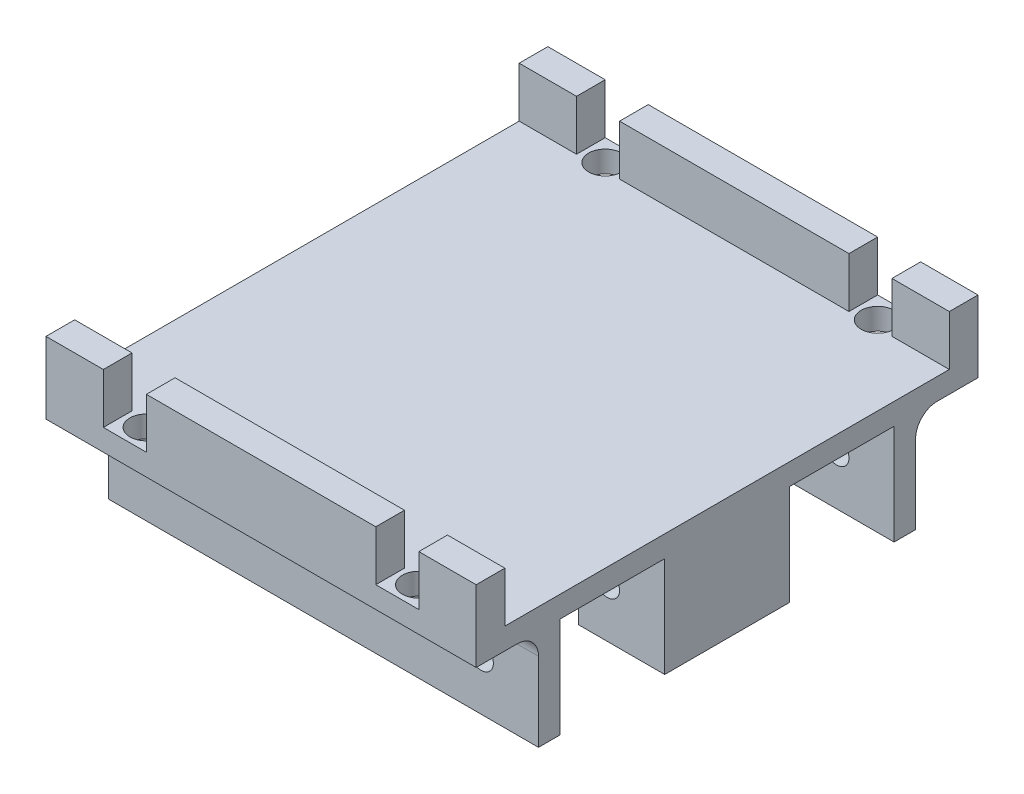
ISO-10303-21;
HEADER;
FILE_DESCRIPTION(('STEP AP214'),'2;1');
FILE_NAME('part.step','',(''),(''),'','','');
FILE_SCHEMA(('AUTOMOTIVE_DESIGN { 1 0 10303 214 1 1 1 1 }'));
ENDSEC;
DATA;
#1=APPLICATION_CONTEXT('core data for automotive mechanical design processes');
#2=APPLICATION_PROTOCOL_DEFINITION('international standard','automotive_design',2000,#1);
#3=PRODUCT_CONTEXT('',#1,'mechanical');
#4=PRODUCT('Part','Part','',(#3));
#5=PRODUCT_RELATED_PRODUCT_CATEGORY('part','',(#4));
#6=PRODUCT_DEFINITION_FORMATION('','',#4);
#7=PRODUCT_DEFINITION_CONTEXT('part definition',#1,'design');
#8=PRODUCT_DEFINITION('design','',#6,#7);
#9=PRODUCT_DEFINITION_SHAPE('','',#8);
#10=(LENGTH_UNIT() NAMED_UNIT(*) SI_UNIT(.MILLI.,.METRE.));
#11=(NAMED_UNIT(*) PLANE_ANGLE_UNIT() SI_UNIT($,.RADIAN.));
#12=(NAMED_UNIT(*) SI_UNIT($,.STERADIAN.) SOLID_ANGLE_UNIT());
#13=UNCERTAINTY_MEASURE_WITH_UNIT(LENGTH_MEASURE(1.E-05),#10,'distance_accuracy_value','');
#14=(GEOMETRIC_REPRESENTATION_CONTEXT(3) GLOBAL_UNCERTAINTY_ASSIGNED_CONTEXT((#13)) GLOBAL_UNIT_ASSIGNED_CONTEXT((#10,
#11,#12)) REPRESENTATION_CONTEXT('',''));
#15=CARTESIAN_POINT('',(0.,0.,0.));
#16=DIRECTION('',(0.,0.,1.));
#17=DIRECTION('',(1.,0.,0.));
#18=AXIS2_PLACEMENT_3D('',#15,#16,#17);
#19=CARTESIAN_POINT('',(60.,0.,6.74316754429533));
#20=DIRECTION('',(0.,0.,1.));
#21=DIRECTION('',(1.,0.,0.));
#22=AXIS2_PLACEMENT_3D('',#19,#20,#21);
#23=PLANE('',#22);
#24=DIRECTION('',(-1.,0.,0.));
#25=VECTOR('',#24,1.);
#26=CARTESIAN_POINT('',(60.,11.1184533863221,6.74316754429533));
#27=LINE('',#26,#25);
#28=CARTESIAN_POINT('',(46.,11.1184533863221,6.74316754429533));
#29=VERTEX_POINT('',#28);
#30=CARTESIAN_POINT('',(14.,11.1184533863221,6.74316754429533));
#31=VERTEX_POINT('',#30);
#32=EDGE_CURVE('E402',#29,#31,#27,.T.);
#33=ORIENTED_EDGE('',*,*,#32,.F.);
#34=DIRECTION('',(0.,1.,0.));
#35=VECTOR('',#34,1.);
#36=CARTESIAN_POINT('',(46.,-3.0926491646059,6.74316754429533));
#37=LINE('',#36,#35);
#38=CARTESIAN_POINT('',(46.,4.11845338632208,6.74316754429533));
#39=VERTEX_POINT('',#38);
#40=EDGE_CURVE('E831',#39,#29,#37,.T.);
#41=ORIENTED_EDGE('',*,*,#40,.F.);
#42=DIRECTION('',(-1.,0.,0.));
#43=VECTOR('',#42,1.);
#44=CARTESIAN_POINT('',(0.,4.11845338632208,6.74316754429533));
#45=LINE('',#44,#43);
#46=CARTESIAN_POINT('',(52.,4.11845338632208,6.74316754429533));
#47=VERTEX_POINT('',#46);
#48=EDGE_CURVE('E834',#47,#39,#45,.T.);
#49=ORIENTED_EDGE('',*,*,#48,.F.);
#50=DIRECTION('',(0.,1.,0.));
#51=VECTOR('',#50,1.);
#52=CARTESIAN_POINT('',(52.,-3.0926491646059,6.74316754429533));
#53=LINE('',#52,#51);
#54=CARTESIAN_POINT('',(52.,11.1184533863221,6.74316754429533));
#55=VERTEX_POINT('',#54);
#56=EDGE_CURVE('E828',#47,#55,#53,.T.);
#57=ORIENTED_EDGE('',*,*,#56,.T.);
#58=CARTESIAN_POINT('',(60.,11.1184533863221,6.74316754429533));
#59=VERTEX_POINT('',#58);
#60=EDGE_CURVE('E398',#59,#55,#27,.T.);
#61=ORIENTED_EDGE('',*,*,#60,.F.);
#62=DIRECTION('',(0.,1.,0.));
#63=VECTOR('',#62,1.);
#64=CARTESIAN_POINT('',(60.,0.,6.74316754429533));
#65=LINE('',#64,#63);
#66=CARTESIAN_POINT('',(60.,1.11845338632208,6.74316754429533));
#67=VERTEX_POINT('',#66);
#68=EDGE_CURVE('E489',#67,#59,#65,.T.);
#69=ORIENTED_EDGE('',*,*,#68,.F.);
#70=DIRECTION('',(-1.,0.,0.));
#71=VECTOR('',#70,1.);
#72=CARTESIAN_POINT('',(60.,1.11845338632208,6.74316754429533));
#73=LINE('',#72,#71);
#74=CARTESIAN_POINT('',(0.,1.11845338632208,6.74316754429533));
#75=VERTEX_POINT('',#74);
#76=EDGE_CURVE('E401',#67,#75,#73,.T.);
#77=ORIENTED_EDGE('',*,*,#76,.T.);
#78=DIRECTION('',(0.,1.,0.));
#79=VECTOR('',#78,1.);
#80=CARTESIAN_POINT('',(0.,0.,6.74316754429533));
#81=LINE('',#80,#79);
#82=CARTESIAN_POINT('',(0.,11.1184533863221,6.74316754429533));
#83=VERTEX_POINT('',#82);
#84=EDGE_CURVE('E507',#75,#83,#81,.T.);
#85=ORIENTED_EDGE('',*,*,#84,.T.);
#86=CARTESIAN_POINT('',(8.,11.1184533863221,6.74316754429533));
#87=VERTEX_POINT('',#86);
#88=EDGE_CURVE('E396',#87,#83,#27,.T.);
#89=ORIENTED_EDGE('',*,*,#88,.F.);
#90=DIRECTION('',(0.,1.,0.));
#91=VECTOR('',#90,1.);
#92=CARTESIAN_POINT('',(8.,-3.0926491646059,6.74316754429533));
#93=LINE('',#92,#91);
#94=CARTESIAN_POINT('',(8.,4.11845338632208,6.74316754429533));
#95=VERTEX_POINT('',#94);
#96=EDGE_CURVE('E793',#95,#87,#93,.T.);
#97=ORIENTED_EDGE('',*,*,#96,.F.);
#98=DIRECTION('',(1.,0.,0.));
#99=VECTOR('',#98,1.);
#100=CARTESIAN_POINT('',(0.,4.11845338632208,6.74316754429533));
#101=LINE('',#100,#99);
#102=CARTESIAN_POINT('',(14.,4.11845338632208,6.74316754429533));
#103=VERTEX_POINT('',#102);
#104=EDGE_CURVE('E800',#95,#103,#101,.T.);
#105=ORIENTED_EDGE('',*,*,#104,.T.);
#106=DIRECTION('',(0.,1.,0.));
#107=VECTOR('',#106,1.);
#108=CARTESIAN_POINT('',(14.,-3.0926491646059,6.74316754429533));
#109=LINE('',#108,#107);
#110=EDGE_CURVE('E788',#103,#31,#109,.T.);
#111=ORIENTED_EDGE('',*,*,#110,.T.);
#112=EDGE_LOOP('',(#33,#41,#49,#57,#61,#69,#77,#85,#89,#97,#105,#111));
#113=FACE_BOUND('',#112,.T.);
#114=ADVANCED_FACE('F37',(#113),#23,.F.);
#115=CARTESIAN_POINT('',(60.,11.1184533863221,0.));
#116=DIRECTION('',(0.,-1.,0.));
#117=DIRECTION('',(0.,0.,-1.));
#118=AXIS2_PLACEMENT_3D('',#115,#116,#117);
#119=PLANE('',#118);
#120=DIRECTION('',(0.,0.,1.));
#121=VECTOR('',#120,1.);
#122=CARTESIAN_POINT('',(52.,11.1184533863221,0.));
#123=LINE('',#122,#121);
#124=CARTESIAN_POINT('',(52.,11.1184533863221,10.7431675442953));
#125=VERTEX_POINT('',#124);
#126=EDGE_CURVE('E792',#55,#125,#123,.T.);
#127=ORIENTED_EDGE('',*,*,#126,.T.);
#128=DIRECTION('',(-1.,0.,0.));
#129=VECTOR('',#128,1.);
#130=CARTESIAN_POINT('',(60.,11.1184533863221,10.7431675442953));
#131=LINE('',#130,#129);
#132=CARTESIAN_POINT('',(60.,11.1184533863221,10.7431675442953));
#133=VERTEX_POINT('',#132);
#134=EDGE_CURVE('E393',#133,#125,#131,.T.);
#135=ORIENTED_EDGE('',*,*,#134,.F.);
#136=DIRECTION('',(0.,0.,1.));
#137=VECTOR('',#136,1.);
#138=CARTESIAN_POINT('',(60.,11.1184533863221,0.));
#139=LINE('',#138,#137);
#140=EDGE_CURVE('E582',#59,#133,#139,.T.);
#141=ORIENTED_EDGE('',*,*,#140,.F.);
#142=ORIENTED_EDGE('',*,*,#60,.T.);
#143=EDGE_LOOP('',(#127,#135,#141,#142));
#144=FACE_BOUND('',#143,.T.);
#145=ADVANCED_FACE('F912',(#144),#119,.F.);
#146=CARTESIAN_POINT('',(46.,11.1184533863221,10.7431675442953));
#147=VERTEX_POINT('',#146);
#148=CARTESIAN_POINT('',(14.,11.1184533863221,10.7431675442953));
#149=VERTEX_POINT('',#148);
#150=EDGE_CURVE('E397',#147,#149,#131,.T.);
#151=ORIENTED_EDGE('',*,*,#150,.F.);
#152=DIRECTION('',(0.,0.,1.));
#153=VECTOR('',#152,1.);
#154=CARTESIAN_POINT('',(46.,11.1184533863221,0.));
#155=LINE('',#154,#153);
#156=EDGE_CURVE('E841',#29,#147,#155,.T.);
#157=ORIENTED_EDGE('',*,*,#156,.F.);
#158=ORIENTED_EDGE('',*,*,#32,.T.);
#159=DIRECTION('',(0.,0.,1.));
#160=VECTOR('',#159,1.);
#161=CARTESIAN_POINT('',(14.,11.1184533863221,0.));
#162=LINE('',#161,#160);
#163=EDGE_CURVE('E791',#31,#149,#162,.T.);
#164=ORIENTED_EDGE('',*,*,#163,.T.);
#165=EDGE_LOOP('',(#151,#157,#158,#164));
#166=FACE_BOUND('',#165,.T.);
#167=ADVANCED_FACE('F917',(#166),#119,.F.);
#168=CARTESIAN_POINT('',(60.,0.,10.7431675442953));
#169=DIRECTION('',(0.,0.,1.));
#170=DIRECTION('',(1.,0.,0.));
#171=AXIS2_PLACEMENT_3D('',#168,#169,#170);
#172=PLANE('',#171);
#173=ORIENTED_EDGE('',*,*,#134,.T.);
#174=DIRECTION('',(0.,1.,0.));
#175=VECTOR('',#174,1.);
#176=CARTESIAN_POINT('',(52.,-3.0926491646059,10.7431675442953));
#177=LINE('',#176,#175);
#178=CARTESIAN_POINT('',(52.,4.11845338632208,10.7431675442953));
#179=VERTEX_POINT('',#178);
#180=EDGE_CURVE('E830',#179,#125,#177,.T.);
#181=ORIENTED_EDGE('',*,*,#180,.F.);
#182=DIRECTION('',(-1.,0.,0.));
#183=VECTOR('',#182,1.);
#184=CARTESIAN_POINT('',(60.,4.11845338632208,10.7431675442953));
#185=LINE('',#184,#183);
#186=CARTESIAN_POINT('',(60.,4.11845338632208,10.7431675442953));
#187=VERTEX_POINT('',#186);
#188=EDGE_CURVE('E388',#187,#179,#185,.T.);
#189=ORIENTED_EDGE('',*,*,#188,.F.);
#190=DIRECTION('',(0.,1.,0.));
#191=VECTOR('',#190,1.);
#192=CARTESIAN_POINT('',(60.,0.,10.7431675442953));
#193=LINE('',#192,#191);
#194=EDGE_CURVE('E584',#187,#133,#193,.T.);
#195=ORIENTED_EDGE('',*,*,#194,.T.);
#196=EDGE_LOOP('',(#173,#181,#189,#195));
#197=FACE_BOUND('',#196,.T.);
#198=ADVANCED_FACE('F1044',(#197),#172,.T.);
#199=DIRECTION('',(0.,1.,0.));
#200=VECTOR('',#199,1.);
#201=CARTESIAN_POINT('',(46.,-3.0926491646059,10.7431675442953));
#202=LINE('',#201,#200);
#203=CARTESIAN_POINT('',(46.,4.11845338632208,10.7431675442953));
#204=VERTEX_POINT('',#203);
#205=EDGE_CURVE('E835',#204,#147,#202,.T.);
#206=ORIENTED_EDGE('',*,*,#205,.T.);
#207=ORIENTED_EDGE('',*,*,#150,.T.);
#208=DIRECTION('',(0.,1.,0.));
#209=VECTOR('',#208,1.);
#210=CARTESIAN_POINT('',(14.,-3.0926491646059,10.7431675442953));
#211=LINE('',#210,#209);
#212=CARTESIAN_POINT('',(14.,4.11845338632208,10.7431675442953));
#213=VERTEX_POINT('',#212);
#214=EDGE_CURVE('E798',#213,#149,#211,.T.);
#215=ORIENTED_EDGE('',*,*,#214,.F.);
#216=EDGE_CURVE('E392',#204,#213,#185,.T.);
#217=ORIENTED_EDGE('',*,*,#216,.F.);
#218=EDGE_LOOP('',(#206,#207,#215,#217));
#219=FACE_BOUND('',#218,.T.);
#220=ADVANCED_FACE('F1045',(#219),#172,.T.);
#221=CARTESIAN_POINT('',(60.,0.,72.7431675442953));
#222=DIRECTION('',(0.,0.,1.));
#223=DIRECTION('',(1.,0.,0.));
#224=AXIS2_PLACEMENT_3D('',#221,#222,#223);
#225=PLANE('',#224);
#226=DIRECTION('',(0.,1.,0.));
#227=VECTOR('',#226,1.);
#228=CARTESIAN_POINT('',(14.,-3.0926491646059,72.7431675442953));
#229=LINE('',#228,#227);
#230=CARTESIAN_POINT('',(14.,4.11845338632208,72.7431675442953));
#231=VERTEX_POINT('',#230);
#232=CARTESIAN_POINT('',(14.,11.1184533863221,72.7431675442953));
#233=VERTEX_POINT('',#232);
#234=EDGE_CURVE('E809',#231,#233,#229,.T.);
#235=ORIENTED_EDGE('',*,*,#234,.T.);
#236=DIRECTION('',(-1.,0.,0.));
#237=VECTOR('',#236,1.);
#238=CARTESIAN_POINT('',(60.,11.1184533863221,72.7431675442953));
#239=LINE('',#238,#237);
#240=CARTESIAN_POINT('',(46.,11.1184533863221,72.7431675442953));
#241=VERTEX_POINT('',#240);
#242=EDGE_CURVE('E371',#241,#233,#239,.T.);
#243=ORIENTED_EDGE('',*,*,#242,.F.);
#244=DIRECTION('',(0.,1.,0.));
#245=VECTOR('',#244,1.);
#246=CARTESIAN_POINT('',(46.,-3.0926491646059,72.7431675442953));
#247=LINE('',#246,#245);
#248=CARTESIAN_POINT('',(46.,4.11845338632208,72.7431675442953));
#249=VERTEX_POINT('',#248);
#250=EDGE_CURVE('E356',#249,#241,#247,.T.);
#251=ORIENTED_EDGE('',*,*,#250,.F.);
#252=DIRECTION('',(-1.,0.,0.));
#253=VECTOR('',#252,1.);
#254=CARTESIAN_POINT('',(60.,4.11845338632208,72.7431675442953));
#255=LINE('',#254,#253);
#256=EDGE_CURVE('E369',#249,#231,#255,.T.);
#257=ORIENTED_EDGE('',*,*,#256,.T.);
#258=EDGE_LOOP('',(#235,#243,#251,#257));
#259=FACE_BOUND('',#258,.T.);
#260=ADVANCED_FACE('F368',(#259),#225,.F.);
#261=DIRECTION('',(0.,1.,0.));
#262=VECTOR('',#261,1.);
#263=CARTESIAN_POINT('',(52.,-3.0926491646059,72.7431675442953));
#264=LINE('',#263,#262);
#265=CARTESIAN_POINT('',(52.,4.11845338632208,72.7431675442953));
#266=VERTEX_POINT('',#265);
#267=CARTESIAN_POINT('',(52.,11.1184533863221,72.7431675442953));
#268=VERTEX_POINT('',#267);
#269=EDGE_CURVE('E847',#266,#268,#264,.T.);
#270=ORIENTED_EDGE('',*,*,#269,.T.);
#271=CARTESIAN_POINT('',(60.,11.1184533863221,72.7431675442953));
#272=VERTEX_POINT('',#271);
#273=EDGE_CURVE('E384',#272,#268,#239,.T.);
#274=ORIENTED_EDGE('',*,*,#273,.F.);
#275=DIRECTION('',(0.,1.,0.));
#276=VECTOR('',#275,1.);
#277=CARTESIAN_POINT('',(60.,0.,72.7431675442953));
#278=LINE('',#277,#276);
#279=CARTESIAN_POINT('',(60.,4.11845338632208,72.7431675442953));
#280=VERTEX_POINT('',#279);
#281=EDGE_CURVE('E593',#280,#272,#278,.T.);
#282=ORIENTED_EDGE('',*,*,#281,.F.);
#283=EDGE_CURVE('E379',#280,#266,#255,.T.);
#284=ORIENTED_EDGE('',*,*,#283,.T.);
#285=EDGE_LOOP('',(#270,#274,#282,#284));
#286=FACE_BOUND('',#285,.T.);
#287=ADVANCED_FACE('F1042',(#286),#225,.F.);
#288=CARTESIAN_POINT('',(60.,11.1184533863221,0.));
#289=DIRECTION('',(0.,1.,0.));
#290=DIRECTION('',(0.,0.,1.));
#291=AXIS2_PLACEMENT_3D('',#288,#289,#290);
#292=PLANE('',#291);
#293=ORIENTED_EDGE('',*,*,#242,.T.);
#294=DIRECTION('',(0.,0.,1.));
#295=VECTOR('',#294,1.);
#296=CARTESIAN_POINT('',(14.,11.1184533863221,0.));
#297=LINE('',#296,#295);
#298=CARTESIAN_POINT('',(14.,11.1184533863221,76.7431675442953));
#299=VERTEX_POINT('',#298);
#300=EDGE_CURVE('E811',#233,#299,#297,.T.);
#301=ORIENTED_EDGE('',*,*,#300,.T.);
#302=DIRECTION('',(-1.,0.,0.));
#303=VECTOR('',#302,1.);
#304=CARTESIAN_POINT('',(60.,11.1184533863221,76.7431675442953));
#305=LINE('',#304,#303);
#306=CARTESIAN_POINT('',(46.,11.1184533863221,76.7431675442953));
#307=VERTEX_POINT('',#306);
#308=EDGE_CURVE('E540',#307,#299,#305,.T.);
#309=ORIENTED_EDGE('',*,*,#308,.F.);
#310=DIRECTION('',(0.,0.,1.));
#311=VECTOR('',#310,1.);
#312=CARTESIAN_POINT('',(46.,11.1184533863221,0.));
#313=LINE('',#312,#311);
#314=EDGE_CURVE('E372',#241,#307,#313,.T.);
#315=ORIENTED_EDGE('',*,*,#314,.F.);
#316=EDGE_LOOP('',(#293,#301,#309,#315));
#317=FACE_BOUND('',#316,.T.);
#318=ADVANCED_FACE('F1039',(#317),#292,.T.);
#319=ORIENTED_EDGE('',*,*,#273,.T.);
#320=DIRECTION('',(0.,0.,1.));
#321=VECTOR('',#320,1.);
#322=CARTESIAN_POINT('',(52.,11.1184533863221,0.));
#323=LINE('',#322,#321);
#324=CARTESIAN_POINT('',(52.,11.1184533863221,76.7431675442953));
#325=VERTEX_POINT('',#324);
#326=EDGE_CURVE('E823',#268,#325,#323,.T.);
#327=ORIENTED_EDGE('',*,*,#326,.T.);
#328=CARTESIAN_POINT('',(60.,11.1184533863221,76.7431675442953));
#329=VERTEX_POINT('',#328);
#330=EDGE_CURVE('E537',#329,#325,#305,.T.);
#331=ORIENTED_EDGE('',*,*,#330,.F.);
#332=DIRECTION('',(0.,0.,-1.));
#333=VECTOR('',#332,1.);
#334=CARTESIAN_POINT('',(60.,11.1184533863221,0.));
#335=LINE('',#334,#333);
#336=EDGE_CURVE('E595',#329,#272,#335,.T.);
#337=ORIENTED_EDGE('',*,*,#336,.T.);
#338=EDGE_LOOP('',(#319,#327,#331,#337));
#339=FACE_BOUND('',#338,.T.);
#340=ADVANCED_FACE('F1040',(#339),#292,.T.);
#341=CARTESIAN_POINT('',(60.,0.,47.4431675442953));
#342=DIRECTION('',(0.,0.,1.));
#343=DIRECTION('',(1.,0.,0.));
#344=AXIS2_PLACEMENT_3D('',#341,#342,#343);
#345=PLANE('',#344);
#346=CARTESIAN_POINT('',(52.,-5.88154661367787,47.4431675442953));
#347=DIRECTION('',(0.,0.,1.));
#348=DIRECTION('',(1.,0.,0.));
#349=AXIS2_PLACEMENT_3D('',#346,#347,#348);
#350=CIRCLE('',#349,1.7);
#351=CARTESIAN_POINT('',(53.7,-5.88154661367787,47.4431675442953));
#352=VERTEX_POINT('',#351);
#353=EDGE_CURVE('E461',#352,#352,#350,.T.);
#354=ORIENTED_EDGE('',*,*,#353,.T.);
#355=EDGE_LOOP('',(#354));
#356=FACE_BOUND('',#355,.T.);
#357=DIRECTION('',(0.,-1.,0.));
#358=VECTOR('',#357,1.);
#359=CARTESIAN_POINT('',(48.,37.243237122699,47.4431675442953));
#360=LINE('',#359,#358);
#361=CARTESIAN_POINT('',(48.,1.11845338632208,47.4431675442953));
#362=VERTEX_POINT('',#361);
#363=CARTESIAN_POINT('',(48.,-12.8815466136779,47.4431675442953));
#364=VERTEX_POINT('',#363);
#365=EDGE_CURVE('E652',#362,#364,#360,.T.);
#366=ORIENTED_EDGE('',*,*,#365,.F.);
#367=DIRECTION('',(-1.,0.,0.));
#368=VECTOR('',#367,1.);
#369=CARTESIAN_POINT('',(60.,1.11845338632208,47.4431675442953));
#370=LINE('',#369,#368);
#371=CARTESIAN_POINT('',(57.,1.11845338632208,47.4431675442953));
#372=VERTEX_POINT('',#371);
#373=EDGE_CURVE('E429',#372,#362,#370,.T.);
#374=ORIENTED_EDGE('',*,*,#373,.F.);
#375=DIRECTION('',(0.,-1.,0.));
#376=VECTOR('',#375,1.);
#377=CARTESIAN_POINT('',(57.,12.9065830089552,47.4431675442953));
#378=LINE('',#377,#376);
#379=CARTESIAN_POINT('',(57.,-12.8815466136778,47.4431675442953));
#380=VERTEX_POINT('',#379);
#381=EDGE_CURVE('E677',#372,#380,#378,.T.);
#382=ORIENTED_EDGE('',*,*,#381,.T.);
#383=DIRECTION('',(-1.,0.,0.));
#384=VECTOR('',#383,1.);
#385=CARTESIAN_POINT('',(60.,-12.8815466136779,47.4431675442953));
#386=LINE('',#385,#384);
#387=EDGE_CURVE('E433',#380,#364,#386,.T.);
#388=ORIENTED_EDGE('',*,*,#387,.T.);
#389=EDGE_LOOP('',(#366,#374,#382,#388));
#390=FACE_BOUND('',#389,.T.);
#391=ADVANCED_FACE('F744',(#356,#390),#345,.F.);
#392=CARTESIAN_POINT('',(60.,0.,36.0431675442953));
#393=DIRECTION('',(0.,0.,-1.));
#394=DIRECTION('',(-1.,0.,0.));
#395=AXIS2_PLACEMENT_3D('',#392,#393,#394);
#396=PLANE('',#395);
#397=CARTESIAN_POINT('',(52.,-5.88154661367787,36.0431675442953));
#398=DIRECTION('',(0.,0.,-1.));
#399=DIRECTION('',(-1.,0.,0.));
#400=AXIS2_PLACEMENT_3D('',#397,#398,#399);
#401=CIRCLE('',#400,1.7);
#402=CARTESIAN_POINT('',(50.3,-5.88154661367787,36.0431675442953));
#403=VERTEX_POINT('',#402);
#404=EDGE_CURVE('E768',#403,#403,#401,.T.);
#405=ORIENTED_EDGE('',*,*,#404,.T.);
#406=EDGE_LOOP('',(#405));
#407=FACE_BOUND('',#406,.T.);
#408=DIRECTION('',(0.,-1.,0.));
#409=VECTOR('',#408,1.);
#410=CARTESIAN_POINT('',(48.,37.243237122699,36.0431675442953));
#411=LINE('',#410,#409);
#412=CARTESIAN_POINT('',(48.,1.11845338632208,36.0431675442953));
#413=VERTEX_POINT('',#412);
#414=CARTESIAN_POINT('',(48.,-12.8815466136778,36.0431675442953));
#415=VERTEX_POINT('',#414);
#416=EDGE_CURVE('E660',#413,#415,#411,.T.);
#417=ORIENTED_EDGE('',*,*,#416,.T.);
#418=DIRECTION('',(-1.,0.,0.));
#419=VECTOR('',#418,1.);
#420=CARTESIAN_POINT('',(60.,-12.8815466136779,36.0431675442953));
#421=LINE('',#420,#419);
#422=CARTESIAN_POINT('',(57.,-12.8815466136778,36.0431675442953));
#423=VERTEX_POINT('',#422);
#424=EDGE_CURVE('E421',#423,#415,#421,.T.);
#425=ORIENTED_EDGE('',*,*,#424,.F.);
#426=DIRECTION('',(0.,-1.,0.));
#427=VECTOR('',#426,1.);
#428=CARTESIAN_POINT('',(57.,12.9065830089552,36.0431675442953));
#429=LINE('',#428,#427);
#430=CARTESIAN_POINT('',(57.,1.11845338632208,36.0431675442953));
#431=VERTEX_POINT('',#430);
#432=EDGE_CURVE('E680',#431,#423,#429,.T.);
#433=ORIENTED_EDGE('',*,*,#432,.F.);
#434=DIRECTION('',(-1.,0.,0.));
#435=VECTOR('',#434,1.);
#436=CARTESIAN_POINT('',(60.,1.11845338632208,36.0431675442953));
#437=LINE('',#436,#435);
#438=EDGE_CURVE('E425',#431,#413,#437,.T.);
#439=ORIENTED_EDGE('',*,*,#438,.T.);
#440=EDGE_LOOP('',(#417,#425,#433,#439));
#441=FACE_BOUND('',#440,.T.);
#442=ADVANCED_FACE('F737',(#407,#441),#396,.F.);
#443=CARTESIAN_POINT('',(60.,0.,50.4431675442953));
#444=DIRECTION('',(0.,0.,1.));
#445=DIRECTION('',(1.,0.,0.));
#446=AXIS2_PLACEMENT_3D('',#443,#444,#445);
#447=PLANE('',#446);
#448=CARTESIAN_POINT('',(52.,-5.88154661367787,50.4431675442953));
#449=DIRECTION('',(0.,0.,1.));
#450=DIRECTION('',(1.,0.,0.));
#451=AXIS2_PLACEMENT_3D('',#448,#449,#450);
#452=CIRCLE('',#451,1.7);
#453=CARTESIAN_POINT('',(53.7,-5.88154661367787,50.4431675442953));
#454=VERTEX_POINT('',#453);
#455=EDGE_CURVE('E771',#454,#454,#452,.T.);
#456=ORIENTED_EDGE('',*,*,#455,.F.);
#457=EDGE_LOOP('',(#456));
#458=FACE_BOUND('',#457,.T.);
#459=DIRECTION('',(-1.,0.,0.));
#460=VECTOR('',#459,1.);
#461=CARTESIAN_POINT('',(60.,1.11845338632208,50.4431675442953));
#462=LINE('',#461,#460);
#463=CARTESIAN_POINT('',(60.,1.11845338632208,50.4431675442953));
#464=VERTEX_POINT('',#463);
#465=CARTESIAN_POINT('',(48.,1.11845338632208,50.4431675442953));
#466=VERTEX_POINT('',#465);
#467=EDGE_CURVE('E441',#464,#466,#462,.T.);
#468=ORIENTED_EDGE('',*,*,#467,.T.);
#469=DIRECTION('',(0.,-1.,0.));
#470=VECTOR('',#469,1.);
#471=CARTESIAN_POINT('',(48.,37.243237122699,50.4431675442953));
#472=LINE('',#471,#470);
#473=CARTESIAN_POINT('',(48.,-12.8815466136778,50.4431675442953));
#474=VERTEX_POINT('',#473);
#475=EDGE_CURVE('E648',#466,#474,#472,.T.);
#476=ORIENTED_EDGE('',*,*,#475,.T.);
#477=DIRECTION('',(-1.,0.,0.));
#478=VECTOR('',#477,1.);
#479=CARTESIAN_POINT('',(60.,-12.8815466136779,50.4431675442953));
#480=LINE('',#479,#478);
#481=CARTESIAN_POINT('',(60.,-12.8815466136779,50.4431675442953));
#482=VERTEX_POINT('',#481);
#483=EDGE_CURVE('E437',#482,#474,#480,.T.);
#484=ORIENTED_EDGE('',*,*,#483,.F.);
#485=DIRECTION('',(0.,1.,0.));
#486=VECTOR('',#485,1.);
#487=CARTESIAN_POINT('',(60.,0.,50.4431675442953));
#488=LINE('',#487,#486);
#489=EDGE_CURVE('E702',#482,#464,#488,.T.);
#490=ORIENTED_EDGE('',*,*,#489,.T.);
#491=EDGE_LOOP('',(#468,#476,#484,#490));
#492=FACE_BOUND('',#491,.T.);
#493=ADVANCED_FACE('F954',(#458,#492),#447,.T.);
#494=CARTESIAN_POINT('',(60.,-12.8815466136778,0.));
#495=DIRECTION('',(0.,1.,0.));
#496=DIRECTION('',(0.,0.,1.));
#497=AXIS2_PLACEMENT_3D('',#494,#495,#496);
#498=PLANE('',#497);
#499=DIRECTION('',(0.,0.,-1.));
#500=VECTOR('',#499,1.);
#501=CARTESIAN_POINT('',(48.,-12.8815466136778,0.));
#502=LINE('',#501,#500);
#503=EDGE_CURVE('E651',#474,#364,#502,.T.);
#504=ORIENTED_EDGE('',*,*,#503,.T.);
#505=ORIENTED_EDGE('',*,*,#387,.F.);
#506=DIRECTION('',(0.,0.,-1.));
#507=VECTOR('',#506,1.);
#508=CARTESIAN_POINT('',(57.,-12.8815466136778,0.));
#509=LINE('',#508,#507);
#510=EDGE_CURVE('E673',#380,#423,#509,.T.);
#511=ORIENTED_EDGE('',*,*,#510,.T.);
#512=ORIENTED_EDGE('',*,*,#424,.T.);
#513=DIRECTION('',(0.,0.,-1.));
#514=VECTOR('',#513,1.);
#515=CARTESIAN_POINT('',(48.,-12.8815466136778,0.));
#516=LINE('',#515,#514);
#517=CARTESIAN_POINT('',(48.,-12.8815466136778,33.0431675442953));
#518=VERTEX_POINT('',#517);
#519=EDGE_CURVE('E657',#415,#518,#516,.T.);
#520=ORIENTED_EDGE('',*,*,#519,.T.);
#521=DIRECTION('',(-1.,0.,0.));
#522=VECTOR('',#521,1.);
#523=CARTESIAN_POINT('',(60.,-12.8815466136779,33.0431675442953));
#524=LINE('',#523,#522);
#525=CARTESIAN_POINT('',(60.,-12.8815466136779,33.0431675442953));
#526=VERTEX_POINT('',#525);
#527=EDGE_CURVE('E417',#526,#518,#524,.T.);
#528=ORIENTED_EDGE('',*,*,#527,.F.);
#529=DIRECTION('',(0.,0.,-1.));
#530=VECTOR('',#529,1.);
#531=CARTESIAN_POINT('',(60.,-12.8815466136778,0.));
#532=LINE('',#531,#530);
#533=EDGE_CURVE('E705',#482,#526,#532,.T.);
#534=ORIENTED_EDGE('',*,*,#533,.F.);
#535=ORIENTED_EDGE('',*,*,#483,.T.);
#536=EDGE_LOOP('',(#504,#505,#511,#512,#520,#528,#534,#535));
#537=FACE_BOUND('',#536,.T.);
#538=ADVANCED_FACE('F732',(#537),#498,.F.);
#539=CARTESIAN_POINT('',(60.,0.,33.0431675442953));
#540=DIRECTION('',(0.,0.,-1.));
#541=DIRECTION('',(-1.,0.,0.));
#542=AXIS2_PLACEMENT_3D('',#539,#540,#541);
#543=PLANE('',#542);
#544=CARTESIAN_POINT('',(52.,-5.88154661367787,33.0431675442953));
#545=DIRECTION('',(0.,0.,-1.));
#546=DIRECTION('',(-1.,0.,0.));
#547=AXIS2_PLACEMENT_3D('',#544,#545,#546);
#548=CIRCLE('',#547,1.7);
#549=CARTESIAN_POINT('',(50.3,-5.88154661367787,33.0431675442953));
#550=VERTEX_POINT('',#549);
#551=EDGE_CURVE('E774',#550,#550,#548,.T.);
#552=ORIENTED_EDGE('',*,*,#551,.F.);
#553=EDGE_LOOP('',(#552));
#554=FACE_BOUND('',#553,.T.);
#555=ORIENTED_EDGE('',*,*,#527,.T.);
#556=DIRECTION('',(0.,-1.,0.));
#557=VECTOR('',#556,1.);
#558=CARTESIAN_POINT('',(48.,37.243237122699,33.0431675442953));
#559=LINE('',#558,#557);
#560=CARTESIAN_POINT('',(48.,1.11845338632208,33.0431675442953));
#561=VERTEX_POINT('',#560);
#562=EDGE_CURVE('E666',#561,#518,#559,.T.);
#563=ORIENTED_EDGE('',*,*,#562,.F.);
#564=DIRECTION('',(-1.,0.,0.));
#565=VECTOR('',#564,1.);
#566=CARTESIAN_POINT('',(60.,1.11845338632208,33.0431675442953));
#567=LINE('',#566,#565);
#568=CARTESIAN_POINT('',(60.,1.11845338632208,33.0431675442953));
#569=VERTEX_POINT('',#568);
#570=EDGE_CURVE('E413',#569,#561,#567,.T.);
#571=ORIENTED_EDGE('',*,*,#570,.F.);
#572=DIRECTION('',(0.,-1.,0.));
#573=VECTOR('',#572,1.);
#574=CARTESIAN_POINT('',(60.,0.,33.0431675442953));
#575=LINE('',#574,#573);
#576=EDGE_CURVE('E707',#569,#526,#575,.T.);
#577=ORIENTED_EDGE('',*,*,#576,.T.);
#578=EDGE_LOOP('',(#555,#563,#571,#577));
#579=FACE_BOUND('',#578,.T.);
#580=ADVANCED_FACE('F725',(#554,#579),#543,.T.);
#581=CARTESIAN_POINT('',(8.,-5.88154661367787,47.4431675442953));
#582=DIRECTION('',(0.,0.,1.));
#583=DIRECTION('',(1.,0.,0.));
#584=AXIS2_PLACEMENT_3D('',#581,#582,#583);
#585=CIRCLE('',#584,1.7);
#586=CARTESIAN_POINT('',(9.7,-5.88154661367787,47.4431675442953));
#587=VERTEX_POINT('',#586);
#588=EDGE_CURVE('E662',#587,#587,#585,.T.);
#589=ORIENTED_EDGE('',*,*,#588,.T.);
#590=EDGE_LOOP('',(#589));
#591=FACE_BOUND('',#590,.T.);
#592=CARTESIAN_POINT('',(12.,1.11845338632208,47.4431675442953));
#593=VERTEX_POINT('',#592);
#594=CARTESIAN_POINT('',(3.,1.11845338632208,47.4431675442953));
#595=VERTEX_POINT('',#594);
#596=EDGE_CURVE('E428',#593,#595,#370,.T.);
#597=ORIENTED_EDGE('',*,*,#596,.F.);
#598=DIRECTION('',(0.,-1.,0.));
#599=VECTOR('',#598,1.);
#600=CARTESIAN_POINT('',(12.,37.243237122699,47.4431675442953));
#601=LINE('',#600,#599);
#602=CARTESIAN_POINT('',(12.,-12.8815466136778,47.4431675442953));
#603=VERTEX_POINT('',#602);
#604=EDGE_CURVE('E641',#593,#603,#601,.T.);
#605=ORIENTED_EDGE('',*,*,#604,.T.);
#606=CARTESIAN_POINT('',(3.,-12.8815466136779,47.4431675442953));
#607=VERTEX_POINT('',#606);
#608=EDGE_CURVE('E432',#603,#607,#386,.T.);
#609=ORIENTED_EDGE('',*,*,#608,.T.);
#610=DIRECTION('',(0.,-1.,0.));
#611=VECTOR('',#610,1.);
#612=CARTESIAN_POINT('',(3.,12.9065830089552,47.4431675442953));
#613=LINE('',#612,#611);
#614=EDGE_CURVE('E687',#595,#607,#613,.T.);
#615=ORIENTED_EDGE('',*,*,#614,.F.);
#616=EDGE_LOOP('',(#597,#605,#609,#615));
#617=FACE_BOUND('',#616,.T.);
#618=ADVANCED_FACE('F945',(#591,#617),#345,.F.);
#619=CARTESIAN_POINT('',(8.,-5.88154661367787,36.0431675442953));
#620=DIRECTION('',(0.,0.,-1.));
#621=DIRECTION('',(-1.,0.,0.));
#622=AXIS2_PLACEMENT_3D('',#619,#620,#621);
#623=CIRCLE('',#622,1.7);
#624=CARTESIAN_POINT('',(6.3,-5.88154661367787,36.0431675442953));
#625=VERTEX_POINT('',#624);
#626=EDGE_CURVE('E752',#625,#625,#623,.T.);
#627=ORIENTED_EDGE('',*,*,#626,.T.);
#628=EDGE_LOOP('',(#627));
#629=FACE_BOUND('',#628,.T.);
#630=CARTESIAN_POINT('',(12.,-12.8815466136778,36.0431675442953));
#631=VERTEX_POINT('',#630);
#632=CARTESIAN_POINT('',(3.,-12.8815466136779,36.0431675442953));
#633=VERTEX_POINT('',#632);
#634=EDGE_CURVE('E420',#631,#633,#421,.T.);
#635=ORIENTED_EDGE('',*,*,#634,.F.);
#636=DIRECTION('',(0.,-1.,0.));
#637=VECTOR('',#636,1.);
#638=CARTESIAN_POINT('',(12.,37.243237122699,36.0431675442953));
#639=LINE('',#638,#637);
#640=CARTESIAN_POINT('',(12.,1.11845338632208,36.0431675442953));
#641=VERTEX_POINT('',#640);
#642=EDGE_CURVE('E655',#641,#631,#639,.T.);
#643=ORIENTED_EDGE('',*,*,#642,.F.);
#644=CARTESIAN_POINT('',(3.,1.11845338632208,36.0431675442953));
#645=VERTEX_POINT('',#644);
#646=EDGE_CURVE('E424',#641,#645,#437,.T.);
#647=ORIENTED_EDGE('',*,*,#646,.T.);
#648=DIRECTION('',(0.,-1.,0.));
#649=VECTOR('',#648,1.);
#650=CARTESIAN_POINT('',(3.,12.9065830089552,36.0431675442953));
#651=LINE('',#650,#649);
#652=EDGE_CURVE('E676',#645,#633,#651,.T.);
#653=ORIENTED_EDGE('',*,*,#652,.T.);
#654=EDGE_LOOP('',(#635,#643,#647,#653));
#655=FACE_BOUND('',#654,.T.);
#656=ADVANCED_FACE('F942',(#629,#655),#396,.F.);
#657=CARTESIAN_POINT('',(60.,1.11845338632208,0.));
#658=DIRECTION('',(0.,1.,0.));
#659=DIRECTION('',(0.,0.,1.));
#660=AXIS2_PLACEMENT_3D('',#657,#658,#659);
#661=PLANE('',#660);
#662=CARTESIAN_POINT('',(11.,1.11845338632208,73.7431675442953));
#663=DIRECTION('',(0.,1.,0.));
#664=DIRECTION('',(0.,0.,1.));
#665=AXIS2_PLACEMENT_3D('',#662,#663,#664);
#666=CIRCLE('',#665,2.29999999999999);
#667=CARTESIAN_POINT('',(11.,1.11845338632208,76.0431675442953));
#668=VERTEX_POINT('',#667);
#669=EDGE_CURVE('E868',#668,#668,#666,.F.);
#670=ORIENTED_EDGE('',*,*,#669,.F.);
#671=EDGE_LOOP('',(#670));
#672=FACE_BOUND('',#671,.T.);
#673=CARTESIAN_POINT('',(49.,1.11845338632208,73.7431675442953));
#674=DIRECTION('',(0.,1.,0.));
#675=DIRECTION('',(0.,0.,1.));
#676=AXIS2_PLACEMENT_3D('',#673,#674,#675);
#677=CIRCLE('',#676,2.30000000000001);
#678=CARTESIAN_POINT('',(49.,1.11845338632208,76.0431675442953));
#679=VERTEX_POINT('',#678);
#680=EDGE_CURVE('E875',#679,#679,#677,.F.);
#681=ORIENTED_EDGE('',*,*,#680,.F.);
#682=EDGE_LOOP('',(#681));
#683=FACE_BOUND('',#682,.T.);
#684=DIRECTION('',(0.,0.,-1.));
#685=VECTOR('',#684,1.);
#686=CARTESIAN_POINT('',(0.,1.11845338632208,0.));
#687=LINE('',#686,#685);
#688=CARTESIAN_POINT('',(0.,1.11845338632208,76.7431675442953));
#689=VERTEX_POINT('',#688);
#690=CARTESIAN_POINT('',(0.,1.11845338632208,71.0431675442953));
#691=VERTEX_POINT('',#690);
#692=EDGE_CURVE('E510',#689,#691,#687,.T.);
#693=ORIENTED_EDGE('',*,*,#692,.T.);
#694=DIRECTION('',(-1.,0.,0.));
#695=VECTOR('',#694,1.);
#696=CARTESIAN_POINT('',(60.,1.11845338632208,71.0431675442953));
#697=LINE('',#696,#695);
#698=CARTESIAN_POINT('',(60.,1.11845338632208,71.0431675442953));
#699=VERTEX_POINT('',#698);
#700=EDGE_CURVE('E52',#691,#699,#697,.F.);
#701=ORIENTED_EDGE('',*,*,#700,.T.);
#702=DIRECTION('',(0.,0.,-1.));
#703=VECTOR('',#702,1.);
#704=CARTESIAN_POINT('',(60.,1.11845338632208,0.));
#705=LINE('',#704,#703);
#706=CARTESIAN_POINT('',(60.,1.11845338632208,76.7431675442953));
#707=VERTEX_POINT('',#706);
#708=EDGE_CURVE('E492',#707,#699,#705,.T.);
#709=ORIENTED_EDGE('',*,*,#708,.F.);
#710=DIRECTION('',(-1.,0.,0.));
#711=VECTOR('',#710,1.);
#712=CARTESIAN_POINT('',(60.,1.11845338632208,76.7431675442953));
#713=LINE('',#712,#711);
#714=EDGE_CURVE('E533',#707,#689,#713,.T.);
#715=ORIENTED_EDGE('',*,*,#714,.T.);
#716=EDGE_LOOP('',(#693,#701,#709,#715));
#717=FACE_BOUND('',#716,.T.);
#718=ADVANCED_FACE('F925',(#672,#683,#717),#661,.F.);
#719=CARTESIAN_POINT('',(60.,0.,68.0431675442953));
#720=DIRECTION('',(0.,0.,-1.));
#721=DIRECTION('',(-1.,0.,0.));
#722=AXIS2_PLACEMENT_3D('',#719,#720,#721);
#723=PLANE('',#722);
#724=CARTESIAN_POINT('',(8.,-5.88154661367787,68.0431675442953));
#725=DIRECTION('',(0.,0.,1.));
#726=DIRECTION('',(1.,0.,0.));
#727=AXIS2_PLACEMENT_3D('',#724,#725,#726);
#728=CIRCLE('',#727,1.7);
#729=CARTESIAN_POINT('',(9.7,-5.88154661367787,68.0431675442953));
#730=VERTEX_POINT('',#729);
#731=EDGE_CURVE('E456',#730,#730,#728,.T.);
#732=ORIENTED_EDGE('',*,*,#731,.F.);
#733=EDGE_LOOP('',(#732));
#734=FACE_BOUND('',#733,.T.);
#735=CARTESIAN_POINT('',(52.,-5.88154661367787,68.0431675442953));
#736=DIRECTION('',(0.,0.,1.));
#737=DIRECTION('',(1.,0.,0.));
#738=AXIS2_PLACEMENT_3D('',#735,#736,#737);
#739=CIRCLE('',#738,1.7);
#740=CARTESIAN_POINT('',(53.7,-5.88154661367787,68.0431675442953));
#741=VERTEX_POINT('',#740);
#742=EDGE_CURVE('E782',#741,#741,#739,.T.);
#743=ORIENTED_EDGE('',*,*,#742,.F.);
#744=EDGE_LOOP('',(#743));
#745=FACE_BOUND('',#744,.T.);
#746=DIRECTION('',(0.,-1.,0.));
#747=VECTOR('',#746,1.);
#748=CARTESIAN_POINT('',(60.,0.,68.0431675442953));
#749=LINE('',#748,#747);
#750=CARTESIAN_POINT('',(60.,-1.88154661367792,68.0431675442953));
#751=VERTEX_POINT('',#750);
#752=CARTESIAN_POINT('',(60.,-12.8815466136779,68.0431675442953));
#753=VERTEX_POINT('',#752);
#754=EDGE_CURVE('E694',#751,#753,#749,.T.);
#755=ORIENTED_EDGE('',*,*,#754,.F.);
#756=DIRECTION('',(-1.,0.,0.));
#757=VECTOR('',#756,1.);
#758=CARTESIAN_POINT('',(0.,-1.88154661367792,68.0431675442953));
#759=LINE('',#758,#757);
#760=CARTESIAN_POINT('',(0.,-1.88154661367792,68.0431675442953));
#761=VERTEX_POINT('',#760);
#762=EDGE_CURVE('E466',#751,#761,#759,.T.);
#763=ORIENTED_EDGE('',*,*,#762,.T.);
#764=DIRECTION('',(0.,-1.,0.));
#765=VECTOR('',#764,1.);
#766=CARTESIAN_POINT('',(0.,0.,68.0431675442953));
#767=LINE('',#766,#765);
#768=CARTESIAN_POINT('',(0.,-12.8815466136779,68.0431675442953));
#769=VERTEX_POINT('',#768);
#770=EDGE_CURVE('E599',#761,#769,#767,.T.);
#771=ORIENTED_EDGE('',*,*,#770,.T.);
#772=DIRECTION('',(-1.,0.,0.));
#773=VECTOR('',#772,1.);
#774=CARTESIAN_POINT('',(60.,-12.8815466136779,68.0431675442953));
#775=LINE('',#774,#773);
#776=EDGE_CURVE('E448',#753,#769,#775,.T.);
#777=ORIENTED_EDGE('',*,*,#776,.F.);
#778=EDGE_LOOP('',(#755,#763,#771,#777));
#779=FACE_BOUND('',#778,.T.);
#780=ADVANCED_FACE('F961',(#734,#745,#779),#723,.F.);
#781=CARTESIAN_POINT('',(60.,-12.8815466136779,0.));
#782=DIRECTION('',(0.,1.,0.));
#783=DIRECTION('',(0.,0.,1.));
#784=AXIS2_PLACEMENT_3D('',#781,#782,#783);
#785=PLANE('',#784);
#786=DIRECTION('',(0.,0.,-1.));
#787=VECTOR('',#786,1.);
#788=CARTESIAN_POINT('',(0.,-12.8815466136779,0.));
#789=LINE('',#788,#787);
#790=CARTESIAN_POINT('',(0.,-12.8815466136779,65.0431675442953));
#791=VERTEX_POINT('',#790);
#792=EDGE_CURVE('E603',#769,#791,#789,.T.);
#793=ORIENTED_EDGE('',*,*,#792,.T.);
#794=DIRECTION('',(-1.,0.,0.));
#795=VECTOR('',#794,1.);
#796=CARTESIAN_POINT('',(60.,-12.8815466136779,65.0431675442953));
#797=LINE('',#796,#795);
#798=CARTESIAN_POINT('',(60.,-12.8815466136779,65.0431675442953));
#799=VERTEX_POINT('',#798);
#800=EDGE_CURVE('E446',#799,#791,#797,.T.);
#801=ORIENTED_EDGE('',*,*,#800,.F.);
#802=DIRECTION('',(0.,0.,-1.));
#803=VECTOR('',#802,1.);
#804=CARTESIAN_POINT('',(60.,-12.8815466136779,0.));
#805=LINE('',#804,#803);
#806=EDGE_CURVE('E697',#753,#799,#805,.T.);
#807=ORIENTED_EDGE('',*,*,#806,.F.);
#808=ORIENTED_EDGE('',*,*,#776,.T.);
#809=EDGE_LOOP('',(#793,#801,#807,#808));
#810=FACE_BOUND('',#809,.T.);
#811=ADVANCED_FACE('F957',(#810),#785,.F.);
#812=CARTESIAN_POINT('',(60.,0.,65.0431675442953));
#813=DIRECTION('',(0.,0.,-1.));
#814=DIRECTION('',(-1.,0.,0.));
#815=AXIS2_PLACEMENT_3D('',#812,#813,#814);
#816=PLANE('',#815);
#817=CARTESIAN_POINT('',(8.,-5.88154661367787,65.0431675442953));
#818=DIRECTION('',(0.,0.,-1.));
#819=DIRECTION('',(-1.,0.,0.));
#820=AXIS2_PLACEMENT_3D('',#817,#818,#819);
#821=CIRCLE('',#820,1.7);
#822=CARTESIAN_POINT('',(6.3,-5.88154661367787,65.0431675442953));
#823=VERTEX_POINT('',#822);
#824=EDGE_CURVE('E755',#823,#823,#821,.T.);
#825=ORIENTED_EDGE('',*,*,#824,.F.);
#826=EDGE_LOOP('',(#825));
#827=FACE_BOUND('',#826,.T.);
#828=CARTESIAN_POINT('',(52.,-5.88154661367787,65.0431675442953));
#829=DIRECTION('',(0.,0.,-1.));
#830=DIRECTION('',(-1.,0.,0.));
#831=AXIS2_PLACEMENT_3D('',#828,#829,#830);
#832=CIRCLE('',#831,1.7);
#833=CARTESIAN_POINT('',(50.3,-5.88154661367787,65.0431675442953));
#834=VERTEX_POINT('',#833);
#835=EDGE_CURVE('E777',#834,#834,#832,.T.);
#836=ORIENTED_EDGE('',*,*,#835,.F.);
#837=EDGE_LOOP('',(#836));
#838=FACE_BOUND('',#837,.T.);
#839=DIRECTION('',(0.,-1.,0.));
#840=VECTOR('',#839,1.);
#841=CARTESIAN_POINT('',(0.,0.,65.0431675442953));
#842=LINE('',#841,#840);
#843=CARTESIAN_POINT('',(0.,1.11845338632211,65.0431675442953));
#844=VERTEX_POINT('',#843);
#845=EDGE_CURVE('E606',#844,#791,#842,.T.);
#846=ORIENTED_EDGE('',*,*,#845,.F.);
#847=DIRECTION('',(-1.,0.,0.));
#848=VECTOR('',#847,1.);
#849=CARTESIAN_POINT('',(60.,1.11845338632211,65.0431675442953));
#850=LINE('',#849,#848);
#851=CARTESIAN_POINT('',(60.,1.11845338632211,65.0431675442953));
#852=VERTEX_POINT('',#851);
#853=EDGE_CURVE('E444',#852,#844,#850,.T.);
#854=ORIENTED_EDGE('',*,*,#853,.F.);
#855=DIRECTION('',(0.,-1.,0.));
#856=VECTOR('',#855,1.);
#857=CARTESIAN_POINT('',(60.,0.,65.0431675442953));
#858=LINE('',#857,#856);
#859=EDGE_CURVE('E699',#852,#799,#858,.T.);
#860=ORIENTED_EDGE('',*,*,#859,.T.);
#861=ORIENTED_EDGE('',*,*,#800,.T.);
#862=EDGE_LOOP('',(#846,#854,#860,#861));
#863=FACE_BOUND('',#862,.T.);
#864=ADVANCED_FACE('F952',(#827,#838,#863),#816,.T.);
#865=CARTESIAN_POINT('',(8.,-5.88154661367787,50.4431675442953));
#866=DIRECTION('',(0.,0.,1.));
#867=DIRECTION('',(1.,0.,0.));
#868=AXIS2_PLACEMENT_3D('',#865,#866,#867);
#869=CIRCLE('',#868,1.7);
#870=CARTESIAN_POINT('',(9.7,-5.88154661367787,50.4431675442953));
#871=VERTEX_POINT('',#870);
#872=EDGE_CURVE('E758',#871,#871,#869,.T.);
#873=ORIENTED_EDGE('',*,*,#872,.F.);
#874=EDGE_LOOP('',(#873));
#875=FACE_BOUND('',#874,.T.);
#876=DIRECTION('',(0.,-1.,0.));
#877=VECTOR('',#876,1.);
#878=CARTESIAN_POINT('',(12.,37.243237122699,50.4431675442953));
#879=LINE('',#878,#877);
#880=CARTESIAN_POINT('',(12.,1.11845338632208,50.4431675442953));
#881=VERTEX_POINT('',#880);
#882=CARTESIAN_POINT('',(12.,-12.8815466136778,50.4431675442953));
#883=VERTEX_POINT('',#882);
#884=EDGE_CURVE('E635',#881,#883,#879,.T.);
#885=ORIENTED_EDGE('',*,*,#884,.F.);
#886=CARTESIAN_POINT('',(0.,1.11845338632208,50.4431675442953));
#887=VERTEX_POINT('',#886);
#888=EDGE_CURVE('E440',#881,#887,#462,.T.);
#889=ORIENTED_EDGE('',*,*,#888,.T.);
#890=DIRECTION('',(0.,1.,0.));
#891=VECTOR('',#890,1.);
#892=CARTESIAN_POINT('',(0.,0.,50.4431675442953));
#893=LINE('',#892,#891);
#894=CARTESIAN_POINT('',(0.,-12.8815466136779,50.4431675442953));
#895=VERTEX_POINT('',#894);
#896=EDGE_CURVE('E609',#895,#887,#893,.T.);
#897=ORIENTED_EDGE('',*,*,#896,.F.);
#898=EDGE_CURVE('E436',#883,#895,#480,.T.);
#899=ORIENTED_EDGE('',*,*,#898,.F.);
#900=EDGE_LOOP('',(#885,#889,#897,#899));
#901=FACE_BOUND('',#900,.T.);
#902=ADVANCED_FACE('F634',(#875,#901),#447,.T.);
#903=ORIENTED_EDGE('',*,*,#608,.F.);
#904=DIRECTION('',(0.,0.,-1.));
#905=VECTOR('',#904,1.);
#906=CARTESIAN_POINT('',(12.,-12.8815466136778,0.));
#907=LINE('',#906,#905);
#908=EDGE_CURVE('E639',#883,#603,#907,.T.);
#909=ORIENTED_EDGE('',*,*,#908,.F.);
#910=ORIENTED_EDGE('',*,*,#898,.T.);
#911=DIRECTION('',(0.,0.,-1.));
#912=VECTOR('',#911,1.);
#913=CARTESIAN_POINT('',(0.,-12.8815466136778,0.));
#914=LINE('',#913,#912);
#915=CARTESIAN_POINT('',(0.,-12.8815466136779,33.0431675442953));
#916=VERTEX_POINT('',#915);
#917=EDGE_CURVE('E612',#895,#916,#914,.T.);
#918=ORIENTED_EDGE('',*,*,#917,.T.);
#919=CARTESIAN_POINT('',(12.,-12.8815466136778,33.0431675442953));
#920=VERTEX_POINT('',#919);
#921=EDGE_CURVE('E416',#920,#916,#524,.T.);
#922=ORIENTED_EDGE('',*,*,#921,.F.);
#923=DIRECTION('',(0.,0.,-1.));
#924=VECTOR('',#923,1.);
#925=CARTESIAN_POINT('',(12.,-12.8815466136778,0.));
#926=LINE('',#925,#924);
#927=EDGE_CURVE('E653',#631,#920,#926,.T.);
#928=ORIENTED_EDGE('',*,*,#927,.F.);
#929=ORIENTED_EDGE('',*,*,#634,.T.);
#930=DIRECTION('',(0.,0.,-1.));
#931=VECTOR('',#930,1.);
#932=CARTESIAN_POINT('',(3.00000000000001,-12.8815466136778,0.));
#933=LINE('',#932,#931);
#934=EDGE_CURVE('E684',#607,#633,#933,.T.);
#935=ORIENTED_EDGE('',*,*,#934,.F.);
#936=EDGE_LOOP('',(#903,#909,#910,#918,#922,#928,#929,#935));
#937=FACE_BOUND('',#936,.T.);
#938=ADVANCED_FACE('F937',(#937),#498,.F.);
#939=CARTESIAN_POINT('',(8.,-5.88154661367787,33.0431675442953));
#940=DIRECTION('',(0.,0.,-1.));
#941=DIRECTION('',(-1.,0.,0.));
#942=AXIS2_PLACEMENT_3D('',#939,#940,#941);
#943=CIRCLE('',#942,1.7);
#944=CARTESIAN_POINT('',(6.3,-5.88154661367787,33.0431675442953));
#945=VERTEX_POINT('',#944);
#946=EDGE_CURVE('E761',#945,#945,#943,.T.);
#947=ORIENTED_EDGE('',*,*,#946,.F.);
#948=EDGE_LOOP('',(#947));
#949=FACE_BOUND('',#948,.T.);
#950=DIRECTION('',(0.,-1.,0.));
#951=VECTOR('',#950,1.);
#952=CARTESIAN_POINT('',(12.,37.243237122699,33.0431675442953));
#953=LINE('',#952,#951);
#954=CARTESIAN_POINT('',(12.,1.11845338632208,33.0431675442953));
#955=VERTEX_POINT('',#954);
#956=EDGE_CURVE('E665',#955,#920,#953,.T.);
#957=ORIENTED_EDGE('',*,*,#956,.T.);
#958=ORIENTED_EDGE('',*,*,#921,.T.);
#959=DIRECTION('',(0.,-1.,0.));
#960=VECTOR('',#959,1.);
#961=CARTESIAN_POINT('',(0.,0.,33.0431675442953));
#962=LINE('',#961,#960);
#963=CARTESIAN_POINT('',(0.,1.11845338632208,33.0431675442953));
#964=VERTEX_POINT('',#963);
#965=EDGE_CURVE('E615',#964,#916,#962,.T.);
#966=ORIENTED_EDGE('',*,*,#965,.F.);
#967=EDGE_CURVE('E412',#955,#964,#567,.T.);
#968=ORIENTED_EDGE('',*,*,#967,.F.);
#969=EDGE_LOOP('',(#957,#958,#966,#968));
#970=FACE_BOUND('',#969,.T.);
#971=ADVANCED_FACE('F934',(#949,#970),#543,.T.);
#972=CARTESIAN_POINT('',(0.,1.11845338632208,18.4431675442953));
#973=VERTEX_POINT('',#972);
#974=EDGE_CURVE('E509',#964,#973,#687,.T.);
#975=ORIENTED_EDGE('',*,*,#974,.T.);
#976=DIRECTION('',(-1.,0.,0.));
#977=VECTOR('',#976,1.);
#978=CARTESIAN_POINT('',(60.,1.11845338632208,18.4431675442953));
#979=LINE('',#978,#977);
#980=CARTESIAN_POINT('',(60.,1.11845338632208,18.4431675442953));
#981=VERTEX_POINT('',#980);
#982=EDGE_CURVE('E410',#981,#973,#979,.T.);
#983=ORIENTED_EDGE('',*,*,#982,.F.);
#984=EDGE_CURVE('E491',#569,#981,#705,.T.);
#985=ORIENTED_EDGE('',*,*,#984,.F.);
#986=ORIENTED_EDGE('',*,*,#570,.T.);
#987=DIRECTION('',(0.,0.,-1.));
#988=VECTOR('',#987,1.);
#989=CARTESIAN_POINT('',(48.,1.11845338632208,0.));
#990=LINE('',#989,#988);
#991=EDGE_CURVE('E656',#413,#561,#990,.T.);
#992=ORIENTED_EDGE('',*,*,#991,.F.);
#993=ORIENTED_EDGE('',*,*,#438,.F.);
#994=DIRECTION('',(0.,0.,-1.));
#995=VECTOR('',#994,1.);
#996=CARTESIAN_POINT('',(57.,1.11845338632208,0.));
#997=LINE('',#996,#995);
#998=EDGE_CURVE('E678',#372,#431,#997,.T.);
#999=ORIENTED_EDGE('',*,*,#998,.F.);
#1000=ORIENTED_EDGE('',*,*,#373,.T.);
#1001=DIRECTION('',(0.,0.,-1.));
#1002=VECTOR('',#1001,1.);
#1003=CARTESIAN_POINT('',(48.,1.11845338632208,0.));
#1004=LINE('',#1003,#1002);
#1005=EDGE_CURVE('E643',#466,#362,#1004,.T.);
#1006=ORIENTED_EDGE('',*,*,#1005,.F.);
#1007=ORIENTED_EDGE('',*,*,#467,.F.);
#1008=EDGE_CURVE('E695',#852,#464,#705,.T.);
#1009=ORIENTED_EDGE('',*,*,#1008,.F.);
#1010=ORIENTED_EDGE('',*,*,#853,.T.);
#1011=EDGE_CURVE('E601',#844,#887,#687,.T.);
#1012=ORIENTED_EDGE('',*,*,#1011,.T.);
#1013=ORIENTED_EDGE('',*,*,#888,.F.);
#1014=DIRECTION('',(0.,0.,-1.));
#1015=VECTOR('',#1014,1.);
#1016=CARTESIAN_POINT('',(12.,1.11845338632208,0.));
#1017=LINE('',#1016,#1015);
#1018=EDGE_CURVE('E638',#881,#593,#1017,.T.);
#1019=ORIENTED_EDGE('',*,*,#1018,.T.);
#1020=ORIENTED_EDGE('',*,*,#596,.T.);
#1021=DIRECTION('',(0.,0.,-1.));
#1022=VECTOR('',#1021,1.);
#1023=CARTESIAN_POINT('',(3.00000000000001,1.11845338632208,0.));
#1024=LINE('',#1023,#1022);
#1025=EDGE_CURVE('E600',#595,#645,#1024,.T.);
#1026=ORIENTED_EDGE('',*,*,#1025,.T.);
#1027=ORIENTED_EDGE('',*,*,#646,.F.);
#1028=DIRECTION('',(0.,0.,-1.));
#1029=VECTOR('',#1028,1.);
#1030=CARTESIAN_POINT('',(12.,1.11845338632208,0.));
#1031=LINE('',#1030,#1029);
#1032=EDGE_CURVE('E663',#641,#955,#1031,.T.);
#1033=ORIENTED_EDGE('',*,*,#1032,.T.);
#1034=ORIENTED_EDGE('',*,*,#967,.T.);
#1035=EDGE_LOOP('',(#975,#983,#985,#986,#992,#993,#999,#1000,#1006,#1007,#1009,#1010,#1012,
#1013,#1019,#1020,#1026,#1027,#1033,#1034));
#1036=FACE_BOUND('',#1035,.T.);
#1037=ADVANCED_FACE('F626',(#1036),#661,.F.);
#1038=CARTESIAN_POINT('',(60.,0.,18.4431675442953));
#1039=DIRECTION('',(0.,0.,1.));
#1040=DIRECTION('',(1.,0.,0.));
#1041=AXIS2_PLACEMENT_3D('',#1038,#1039,#1040);
#1042=PLANE('',#1041);
#1043=CARTESIAN_POINT('',(8.,-5.88154661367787,18.4431675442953));
#1044=DIRECTION('',(0.,0.,1.));
#1045=DIRECTION('',(1.,0.,0.));
#1046=AXIS2_PLACEMENT_3D('',#1043,#1044,#1045);
#1047=CIRCLE('',#1046,1.7);
#1048=CARTESIAN_POINT('',(9.7,-5.88154661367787,18.4431675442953));
#1049=VERTEX_POINT('',#1048);
#1050=EDGE_CURVE('E460',#1049,#1049,#1047,.T.);
#1051=ORIENTED_EDGE('',*,*,#1050,.F.);
#1052=EDGE_LOOP('',(#1051));
#1053=FACE_BOUND('',#1052,.T.);
#1054=CARTESIAN_POINT('',(52.,-5.88154661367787,18.4431675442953));
#1055=DIRECTION('',(0.,0.,1.));
#1056=DIRECTION('',(1.,0.,0.));
#1057=AXIS2_PLACEMENT_3D('',#1054,#1055,#1056);
#1058=CIRCLE('',#1057,1.7);
#1059=CARTESIAN_POINT('',(53.7,-5.88154661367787,18.4431675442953));
#1060=VERTEX_POINT('',#1059);
#1061=EDGE_CURVE('E455',#1060,#1060,#1058,.T.);
#1062=ORIENTED_EDGE('',*,*,#1061,.F.);
#1063=EDGE_LOOP('',(#1062));
#1064=FACE_BOUND('',#1063,.T.);
#1065=DIRECTION('',(0.,1.,0.));
#1066=VECTOR('',#1065,1.);
#1067=CARTESIAN_POINT('',(0.,0.,18.4431675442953));
#1068=LINE('',#1067,#1066);
#1069=CARTESIAN_POINT('',(0.,-12.8815466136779,18.4431675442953));
#1070=VERTEX_POINT('',#1069);
#1071=EDGE_CURVE('E511',#1070,#973,#1068,.T.);
#1072=ORIENTED_EDGE('',*,*,#1071,.F.);
#1073=DIRECTION('',(-1.,0.,0.));
#1074=VECTOR('',#1073,1.);
#1075=CARTESIAN_POINT('',(60.,-12.8815466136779,18.4431675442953));
#1076=LINE('',#1075,#1074);
#1077=CARTESIAN_POINT('',(60.,-12.8815466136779,18.4431675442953));
#1078=VERTEX_POINT('',#1077);
#1079=EDGE_CURVE('E408',#1078,#1070,#1076,.T.);
#1080=ORIENTED_EDGE('',*,*,#1079,.F.);
#1081=DIRECTION('',(0.,1.,0.));
#1082=VECTOR('',#1081,1.);
#1083=CARTESIAN_POINT('',(60.,0.,18.4431675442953));
#1084=LINE('',#1083,#1082);
#1085=EDGE_CURVE('E710',#1078,#981,#1084,.T.);
#1086=ORIENTED_EDGE('',*,*,#1085,.T.);
#1087=ORIENTED_EDGE('',*,*,#982,.T.);
#1088=EDGE_LOOP('',(#1072,#1080,#1086,#1087));
#1089=FACE_BOUND('',#1088,.T.);
#1090=ADVANCED_FACE('F718',(#1053,#1064,#1089),#1042,.T.);
#1091=CARTESIAN_POINT('',(60.,-12.8815466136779,0.));
#1092=DIRECTION('',(0.,1.,0.));
#1093=DIRECTION('',(0.,0.,1.));
#1094=AXIS2_PLACEMENT_3D('',#1091,#1092,#1093);
#1095=PLANE('',#1094);
#1096=DIRECTION('',(0.,0.,-1.));
#1097=VECTOR('',#1096,1.);
#1098=CARTESIAN_POINT('',(0.,-12.8815466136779,0.));
#1099=LINE('',#1098,#1097);
#1100=CARTESIAN_POINT('',(0.,-12.8815466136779,15.4431675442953));
#1101=VERTEX_POINT('',#1100);
#1102=EDGE_CURVE('E505',#1070,#1101,#1099,.T.);
#1103=ORIENTED_EDGE('',*,*,#1102,.T.);
#1104=DIRECTION('',(-1.,0.,0.));
#1105=VECTOR('',#1104,1.);
#1106=CARTESIAN_POINT('',(60.,-12.8815466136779,15.4431675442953));
#1107=LINE('',#1106,#1105);
#1108=CARTESIAN_POINT('',(60.,-12.8815466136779,15.4431675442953));
#1109=VERTEX_POINT('',#1108);
#1110=EDGE_CURVE('E405',#1109,#1101,#1107,.T.);
#1111=ORIENTED_EDGE('',*,*,#1110,.F.);
#1112=DIRECTION('',(0.,0.,-1.));
#1113=VECTOR('',#1112,1.);
#1114=CARTESIAN_POINT('',(60.,-12.8815466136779,0.));
#1115=LINE('',#1114,#1113);
#1116=EDGE_CURVE('E712',#1078,#1109,#1115,.T.);
#1117=ORIENTED_EDGE('',*,*,#1116,.F.);
#1118=ORIENTED_EDGE('',*,*,#1079,.T.);
#1119=EDGE_LOOP('',(#1103,#1111,#1117,#1118));
#1120=FACE_BOUND('',#1119,.T.);
#1121=ADVANCED_FACE('F716',(#1120),#1095,.F.);
#1122=CARTESIAN_POINT('',(60.,0.,15.4431675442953));
#1123=DIRECTION('',(0.,0.,1.));
#1124=DIRECTION('',(1.,0.,0.));
#1125=AXIS2_PLACEMENT_3D('',#1122,#1123,#1124);
#1126=PLANE('',#1125);
#1127=CARTESIAN_POINT('',(8.,-5.88154661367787,15.4431675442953));
#1128=DIRECTION('',(0.,0.,1.));
#1129=DIRECTION('',(1.,0.,0.));
#1130=AXIS2_PLACEMENT_3D('',#1127,#1128,#1129);
#1131=CIRCLE('',#1130,1.7);
#1132=CARTESIAN_POINT('',(9.7,-5.88154661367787,15.4431675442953));
#1133=VERTEX_POINT('',#1132);
#1134=EDGE_CURVE('E457',#1133,#1133,#1131,.T.);
#1135=ORIENTED_EDGE('',*,*,#1134,.T.);
#1136=EDGE_LOOP('',(#1135));
#1137=FACE_BOUND('',#1136,.T.);
#1138=CARTESIAN_POINT('',(52.,-5.88154661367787,15.4431675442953));
#1139=DIRECTION('',(0.,0.,1.));
#1140=DIRECTION('',(1.,0.,0.));
#1141=AXIS2_PLACEMENT_3D('',#1138,#1139,#1140);
#1142=CIRCLE('',#1141,1.7);
#1143=CARTESIAN_POINT('',(53.7,-5.88154661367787,15.4431675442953));
#1144=VERTEX_POINT('',#1143);
#1145=EDGE_CURVE('E452',#1144,#1144,#1142,.T.);
#1146=ORIENTED_EDGE('',*,*,#1145,.T.);
#1147=EDGE_LOOP('',(#1146));
#1148=FACE_BOUND('',#1147,.T.);
#1149=DIRECTION('',(0.,1.,0.));
#1150=VECTOR('',#1149,1.);
#1151=CARTESIAN_POINT('',(0.,0.,15.4431675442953));
#1152=LINE('',#1151,#1150);
#1153=CARTESIAN_POINT('',(0.,-1.88154661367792,15.4431675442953));
#1154=VERTEX_POINT('',#1153);
#1155=EDGE_CURVE('E499',#1101,#1154,#1152,.T.);
#1156=ORIENTED_EDGE('',*,*,#1155,.T.);
#1157=DIRECTION('',(-1.,0.,0.));
#1158=VECTOR('',#1157,1.);
#1159=CARTESIAN_POINT('',(60.,-1.88154661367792,15.4431675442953));
#1160=LINE('',#1159,#1158);
#1161=CARTESIAN_POINT('',(60.,-1.88154661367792,15.4431675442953));
#1162=VERTEX_POINT('',#1161);
#1163=EDGE_CURVE('E464',#1154,#1162,#1160,.F.);
#1164=ORIENTED_EDGE('',*,*,#1163,.T.);
#1165=DIRECTION('',(0.,1.,0.));
#1166=VECTOR('',#1165,1.);
#1167=CARTESIAN_POINT('',(60.,0.,15.4431675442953));
#1168=LINE('',#1167,#1166);
#1169=EDGE_CURVE('E481',#1109,#1162,#1168,.T.);
#1170=ORIENTED_EDGE('',*,*,#1169,.F.);
#1171=ORIENTED_EDGE('',*,*,#1110,.T.);
#1172=EDGE_LOOP('',(#1156,#1164,#1170,#1171));
#1173=FACE_BOUND('',#1172,.T.);
#1174=ADVANCED_FACE('F503',(#1137,#1148,#1173),#1126,.F.);
#1175=CARTESIAN_POINT('',(49.,1.11845338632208,9.74316754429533));
#1176=DIRECTION('',(0.,1.,0.));
#1177=DIRECTION('',(0.,0.,1.));
#1178=AXIS2_PLACEMENT_3D('',#1175,#1176,#1177);
#1179=CIRCLE('',#1178,2.30000000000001);
#1180=CARTESIAN_POINT('',(49.,1.11845338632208,12.0431675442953));
#1181=VERTEX_POINT('',#1180);
#1182=EDGE_CURVE('E867',#1181,#1181,#1179,.F.);
#1183=ORIENTED_EDGE('',*,*,#1182,.F.);
#1184=EDGE_LOOP('',(#1183));
#1185=FACE_BOUND('',#1184,.T.);
#1186=CARTESIAN_POINT('',(11.,1.11845338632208,9.74316754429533));
#1187=DIRECTION('',(0.,1.,0.));
#1188=DIRECTION('',(0.,0.,1.));
#1189=AXIS2_PLACEMENT_3D('',#1186,#1187,#1188);
#1190=CIRCLE('',#1189,2.3);
#1191=CARTESIAN_POINT('',(11.,1.11845338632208,12.0431675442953));
#1192=VERTEX_POINT('',#1191);
#1193=EDGE_CURVE('E858',#1192,#1192,#1190,.F.);
#1194=ORIENTED_EDGE('',*,*,#1193,.F.);
#1195=EDGE_LOOP('',(#1194));
#1196=FACE_BOUND('',#1195,.T.);
#1197=CARTESIAN_POINT('',(60.,1.11845338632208,12.4431675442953));
#1198=VERTEX_POINT('',#1197);
#1199=EDGE_CURVE('E478',#1198,#67,#705,.T.);
#1200=ORIENTED_EDGE('',*,*,#1199,.F.);
#1201=DIRECTION('',(-1.,0.,0.));
#1202=VECTOR('',#1201,1.);
#1203=CARTESIAN_POINT('',(0.,1.11845338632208,12.4431675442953));
#1204=LINE('',#1203,#1202);
#1205=CARTESIAN_POINT('',(0.,1.11845338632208,12.4431675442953));
#1206=VERTEX_POINT('',#1205);
#1207=EDGE_CURVE('E451',#1198,#1206,#1204,.T.);
#1208=ORIENTED_EDGE('',*,*,#1207,.T.);
#1209=EDGE_CURVE('E501',#1206,#75,#687,.T.);
#1210=ORIENTED_EDGE('',*,*,#1209,.T.);
#1211=ORIENTED_EDGE('',*,*,#76,.F.);
#1212=EDGE_LOOP('',(#1200,#1208,#1210,#1211));
#1213=FACE_BOUND('',#1212,.T.);
#1214=ADVANCED_FACE('F486',(#1185,#1196,#1213),#661,.F.);
#1215=CARTESIAN_POINT('',(8.,11.1184533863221,10.7431675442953));
#1216=VERTEX_POINT('',#1215);
#1217=CARTESIAN_POINT('',(0.,11.1184533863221,10.7431675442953));
#1218=VERTEX_POINT('',#1217);
#1219=EDGE_CURVE('E391',#1216,#1218,#131,.T.);
#1220=ORIENTED_EDGE('',*,*,#1219,.F.);
#1221=DIRECTION('',(0.,0.,1.));
#1222=VECTOR('',#1221,1.);
#1223=CARTESIAN_POINT('',(8.,11.1184533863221,0.));
#1224=LINE('',#1223,#1222);
#1225=EDGE_CURVE('E795',#87,#1216,#1224,.T.);
#1226=ORIENTED_EDGE('',*,*,#1225,.F.);
#1227=ORIENTED_EDGE('',*,*,#88,.T.);
#1228=DIRECTION('',(0.,0.,1.));
#1229=VECTOR('',#1228,1.);
#1230=CARTESIAN_POINT('',(0.,11.1184533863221,0.));
#1231=LINE('',#1230,#1229);
#1232=EDGE_CURVE('E517',#83,#1218,#1231,.T.);
#1233=ORIENTED_EDGE('',*,*,#1232,.T.);
#1234=EDGE_LOOP('',(#1220,#1226,#1227,#1233));
#1235=FACE_BOUND('',#1234,.T.);
#1236=ADVANCED_FACE('F574',(#1235),#119,.F.);
#1237=DIRECTION('',(0.,1.,0.));
#1238=VECTOR('',#1237,1.);
#1239=CARTESIAN_POINT('',(8.,-3.0926491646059,10.7431675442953));
#1240=LINE('',#1239,#1238);
#1241=CARTESIAN_POINT('',(8.,4.11845338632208,10.7431675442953));
#1242=VERTEX_POINT('',#1241);
#1243=EDGE_CURVE('E571',#1242,#1216,#1240,.T.);
#1244=ORIENTED_EDGE('',*,*,#1243,.T.);
#1245=ORIENTED_EDGE('',*,*,#1219,.T.);
#1246=DIRECTION('',(0.,1.,0.));
#1247=VECTOR('',#1246,1.);
#1248=CARTESIAN_POINT('',(0.,0.,10.7431675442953));
#1249=LINE('',#1248,#1247);
#1250=CARTESIAN_POINT('',(0.,4.11845338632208,10.7431675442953));
#1251=VERTEX_POINT('',#1250);
#1252=EDGE_CURVE('E520',#1251,#1218,#1249,.T.);
#1253=ORIENTED_EDGE('',*,*,#1252,.F.);
#1254=EDGE_CURVE('E383',#1242,#1251,#185,.T.);
#1255=ORIENTED_EDGE('',*,*,#1254,.F.);
#1256=EDGE_LOOP('',(#1244,#1245,#1253,#1255));
#1257=FACE_BOUND('',#1256,.T.);
#1258=ADVANCED_FACE('F569',(#1257),#172,.T.);
#1259=CARTESIAN_POINT('',(60.,4.11845338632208,0.));
#1260=DIRECTION('',(0.,-1.,0.));
#1261=DIRECTION('',(0.,0.,-1.));
#1262=AXIS2_PLACEMENT_3D('',#1259,#1260,#1261);
#1263=PLANE('',#1262);
#1264=CARTESIAN_POINT('',(11.,4.11845338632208,73.7431675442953));
#1265=DIRECTION('',(0.,1.,0.));
#1266=DIRECTION('',(0.,0.,1.));
#1267=AXIS2_PLACEMENT_3D('',#1264,#1265,#1266);
#1268=CIRCLE('',#1267,2.29999999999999);
#1269=CARTESIAN_POINT('',(11.,4.11845338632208,76.0431675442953));
#1270=VERTEX_POINT('',#1269);
#1271=EDGE_CURVE('E872',#1270,#1270,#1268,.T.);
#1272=ORIENTED_EDGE('',*,*,#1271,.F.);
#1273=EDGE_LOOP('',(#1272));
#1274=FACE_BOUND('',#1273,.T.);
#1275=CARTESIAN_POINT('',(49.,4.11845338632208,73.7431675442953));
#1276=DIRECTION('',(0.,1.,0.));
#1277=DIRECTION('',(0.,0.,1.));
#1278=AXIS2_PLACEMENT_3D('',#1275,#1276,#1277);
#1279=CIRCLE('',#1278,2.30000000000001);
#1280=CARTESIAN_POINT('',(49.,4.11845338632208,76.0431675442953));
#1281=VERTEX_POINT('',#1280);
#1282=EDGE_CURVE('E871',#1281,#1281,#1279,.T.);
#1283=ORIENTED_EDGE('',*,*,#1282,.F.);
#1284=EDGE_LOOP('',(#1283));
#1285=FACE_BOUND('',#1284,.T.);
#1286=CARTESIAN_POINT('',(49.,4.11845338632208,9.74316754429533));
#1287=DIRECTION('',(0.,1.,0.));
#1288=DIRECTION('',(0.,0.,1.));
#1289=AXIS2_PLACEMENT_3D('',#1286,#1287,#1288);
#1290=CIRCLE('',#1289,2.30000000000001);
#1291=CARTESIAN_POINT('',(49.,4.11845338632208,12.0431675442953));
#1292=VERTEX_POINT('',#1291);
#1293=EDGE_CURVE('E878',#1292,#1292,#1290,.T.);
#1294=ORIENTED_EDGE('',*,*,#1293,.F.);
#1295=EDGE_LOOP('',(#1294));
#1296=FACE_BOUND('',#1295,.T.);
#1297=CARTESIAN_POINT('',(11.,4.11845338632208,9.74316754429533));
#1298=DIRECTION('',(0.,1.,0.));
#1299=DIRECTION('',(0.,0.,1.));
#1300=AXIS2_PLACEMENT_3D('',#1297,#1298,#1299);
#1301=CIRCLE('',#1300,2.3);
#1302=CARTESIAN_POINT('',(11.,4.11845338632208,12.0431675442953));
#1303=VERTEX_POINT('',#1302);
#1304=EDGE_CURVE('E864',#1303,#1303,#1301,.T.);
#1305=ORIENTED_EDGE('',*,*,#1304,.F.);
#1306=EDGE_LOOP('',(#1305));
#1307=FACE_BOUND('',#1306,.T.);
#1308=DIRECTION('',(0.,0.,1.));
#1309=VECTOR('',#1308,1.);
#1310=CARTESIAN_POINT('',(0.,4.11845338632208,0.));
#1311=LINE('',#1310,#1309);
#1312=CARTESIAN_POINT('',(0.,4.11845338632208,72.7431675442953));
#1313=VERTEX_POINT('',#1312);
#1314=EDGE_CURVE('E523',#1251,#1313,#1311,.T.);
#1315=ORIENTED_EDGE('',*,*,#1314,.T.);
#1316=CARTESIAN_POINT('',(8.,4.11845338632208,72.7431675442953));
#1317=VERTEX_POINT('',#1316);
#1318=EDGE_CURVE('E380',#1317,#1313,#255,.T.);
#1319=ORIENTED_EDGE('',*,*,#1318,.F.);
#1320=DIRECTION('',(0.,0.,1.));
#1321=VECTOR('',#1320,1.);
#1322=CARTESIAN_POINT('',(8.,4.11845338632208,0.));
#1323=LINE('',#1322,#1321);
#1324=CARTESIAN_POINT('',(8.,4.11845338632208,76.7431675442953));
#1325=VERTEX_POINT('',#1324);
#1326=EDGE_CURVE('E815',#1317,#1325,#1323,.T.);
#1327=ORIENTED_EDGE('',*,*,#1326,.T.);
#1328=DIRECTION('',(1.,0.,0.));
#1329=VECTOR('',#1328,1.);
#1330=CARTESIAN_POINT('',(0.,4.11845338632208,76.7431675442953));
#1331=LINE('',#1330,#1329);
#1332=CARTESIAN_POINT('',(14.,4.11845338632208,76.7431675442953));
#1333=VERTEX_POINT('',#1332);
#1334=EDGE_CURVE('E817',#1325,#1333,#1331,.T.);
#1335=ORIENTED_EDGE('',*,*,#1334,.T.);
#1336=DIRECTION('',(0.,0.,1.));
#1337=VECTOR('',#1336,1.);
#1338=CARTESIAN_POINT('',(14.,4.11845338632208,0.));
#1339=LINE('',#1338,#1337);
#1340=EDGE_CURVE('E377',#231,#1333,#1339,.T.);
#1341=ORIENTED_EDGE('',*,*,#1340,.F.);
#1342=ORIENTED_EDGE('',*,*,#256,.F.);
#1343=DIRECTION('',(0.,0.,1.));
#1344=VECTOR('',#1343,1.);
#1345=CARTESIAN_POINT('',(46.,4.11845338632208,0.));
#1346=LINE('',#1345,#1344);
#1347=CARTESIAN_POINT('',(46.,4.11845338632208,76.7431675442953));
#1348=VERTEX_POINT('',#1347);
#1349=EDGE_CURVE('E353',#249,#1348,#1346,.T.);
#1350=ORIENTED_EDGE('',*,*,#1349,.T.);
#1351=DIRECTION('',(1.,0.,0.));
#1352=VECTOR('',#1351,1.);
#1353=CARTESIAN_POINT('',(0.,4.11845338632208,76.7431675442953));
#1354=LINE('',#1353,#1352);
#1355=CARTESIAN_POINT('',(52.,4.11845338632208,76.7431675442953));
#1356=VERTEX_POINT('',#1355);
#1357=EDGE_CURVE('E852',#1348,#1356,#1354,.T.);
#1358=ORIENTED_EDGE('',*,*,#1357,.T.);
#1359=DIRECTION('',(0.,0.,1.));
#1360=VECTOR('',#1359,1.);
#1361=CARTESIAN_POINT('',(52.,4.11845338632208,0.));
#1362=LINE('',#1361,#1360);
#1363=EDGE_CURVE('E855',#266,#1356,#1362,.T.);
#1364=ORIENTED_EDGE('',*,*,#1363,.F.);
#1365=ORIENTED_EDGE('',*,*,#283,.F.);
#1366=DIRECTION('',(0.,0.,1.));
#1367=VECTOR('',#1366,1.);
#1368=CARTESIAN_POINT('',(60.,4.11845338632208,0.));
#1369=LINE('',#1368,#1367);
#1370=EDGE_CURVE('E591',#187,#280,#1369,.T.);
#1371=ORIENTED_EDGE('',*,*,#1370,.F.);
#1372=ORIENTED_EDGE('',*,*,#188,.T.);
#1373=DIRECTION('',(0.,0.,1.));
#1374=VECTOR('',#1373,1.);
#1375=CARTESIAN_POINT('',(52.,4.11845338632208,0.));
#1376=LINE('',#1375,#1374);
#1377=EDGE_CURVE('E826',#47,#179,#1376,.T.);
#1378=ORIENTED_EDGE('',*,*,#1377,.F.);
#1379=ORIENTED_EDGE('',*,*,#48,.T.);
#1380=DIRECTION('',(0.,0.,1.));
#1381=VECTOR('',#1380,1.);
#1382=CARTESIAN_POINT('',(46.,4.11845338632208,0.));
#1383=LINE('',#1382,#1381);
#1384=EDGE_CURVE('E833',#39,#204,#1383,.T.);
#1385=ORIENTED_EDGE('',*,*,#1384,.T.);
#1386=ORIENTED_EDGE('',*,*,#216,.T.);
#1387=DIRECTION('',(0.,0.,1.));
#1388=VECTOR('',#1387,1.);
#1389=CARTESIAN_POINT('',(14.,4.11845338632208,0.));
#1390=LINE('',#1389,#1388);
#1391=EDGE_CURVE('E785',#103,#213,#1390,.T.);
#1392=ORIENTED_EDGE('',*,*,#1391,.F.);
#1393=ORIENTED_EDGE('',*,*,#104,.F.);
#1394=DIRECTION('',(0.,0.,1.));
#1395=VECTOR('',#1394,1.);
#1396=CARTESIAN_POINT('',(8.,4.11845338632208,0.));
#1397=LINE('',#1396,#1395);
#1398=EDGE_CURVE('E797',#95,#1242,#1397,.T.);
#1399=ORIENTED_EDGE('',*,*,#1398,.T.);
#1400=ORIENTED_EDGE('',*,*,#1254,.T.);
#1401=EDGE_LOOP('',(#1315,#1319,#1327,#1335,#1341,#1342,#1350,#1358,#1364,#1365,#1371,#1372,
#1378,#1379,#1385,#1386,#1392,#1393,#1399,#1400));
#1402=FACE_BOUND('',#1401,.T.);
#1403=ADVANCED_FACE('F375',(#1274,#1285,#1296,#1307,#1402),#1263,.F.);
#1404=CARTESIAN_POINT('',(8.,11.1184533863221,72.7431675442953));
#1405=VERTEX_POINT('',#1404);
#1406=CARTESIAN_POINT('',(0.,11.1184533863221,72.7431675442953));
#1407=VERTEX_POINT('',#1406);
#1408=EDGE_CURVE('E539',#1405,#1407,#239,.T.);
#1409=ORIENTED_EDGE('',*,*,#1408,.F.);
#1410=DIRECTION('',(0.,1.,0.));
#1411=VECTOR('',#1410,1.);
#1412=CARTESIAN_POINT('',(8.,-3.0926491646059,72.7431675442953));
#1413=LINE('',#1412,#1411);
#1414=EDGE_CURVE('E813',#1317,#1405,#1413,.T.);
#1415=ORIENTED_EDGE('',*,*,#1414,.F.);
#1416=ORIENTED_EDGE('',*,*,#1318,.T.);
#1417=DIRECTION('',(0.,1.,0.));
#1418=VECTOR('',#1417,1.);
#1419=CARTESIAN_POINT('',(0.,0.,72.7431675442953));
#1420=LINE('',#1419,#1418);
#1421=EDGE_CURVE('E525',#1313,#1407,#1420,.T.);
#1422=ORIENTED_EDGE('',*,*,#1421,.T.);
#1423=EDGE_LOOP('',(#1409,#1415,#1416,#1422));
#1424=FACE_BOUND('',#1423,.T.);
#1425=ADVANCED_FACE('F561',(#1424),#225,.F.);
#1426=DIRECTION('',(0.,0.,1.));
#1427=VECTOR('',#1426,1.);
#1428=CARTESIAN_POINT('',(8.,11.1184533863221,0.));
#1429=LINE('',#1428,#1427);
#1430=CARTESIAN_POINT('',(8.,11.1184533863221,76.7431675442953));
#1431=VERTEX_POINT('',#1430);
#1432=EDGE_CURVE('E558',#1405,#1431,#1429,.T.);
#1433=ORIENTED_EDGE('',*,*,#1432,.F.);
#1434=ORIENTED_EDGE('',*,*,#1408,.T.);
#1435=DIRECTION('',(0.,0.,-1.));
#1436=VECTOR('',#1435,1.);
#1437=CARTESIAN_POINT('',(0.,11.1184533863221,0.));
#1438=LINE('',#1437,#1436);
#1439=CARTESIAN_POINT('',(0.,11.1184533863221,76.7431675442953));
#1440=VERTEX_POINT('',#1439);
#1441=EDGE_CURVE('E528',#1440,#1407,#1438,.T.);
#1442=ORIENTED_EDGE('',*,*,#1441,.F.);
#1443=EDGE_CURVE('E535',#1431,#1440,#305,.T.);
#1444=ORIENTED_EDGE('',*,*,#1443,.F.);
#1445=EDGE_LOOP('',(#1433,#1434,#1442,#1444));
#1446=FACE_BOUND('',#1445,.T.);
#1447=ADVANCED_FACE('F556',(#1446),#292,.T.);
#1448=CARTESIAN_POINT('',(60.,0.,76.7431675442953));
#1449=DIRECTION('',(0.,0.,-1.));
#1450=DIRECTION('',(-1.,0.,0.));
#1451=AXIS2_PLACEMENT_3D('',#1448,#1449,#1450);
#1452=PLANE('',#1451);
#1453=ORIENTED_EDGE('',*,*,#1334,.F.);
#1454=DIRECTION('',(0.,1.,0.));
#1455=VECTOR('',#1454,1.);
#1456=CARTESIAN_POINT('',(8.,-3.0926491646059,76.7431675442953));
#1457=LINE('',#1456,#1455);
#1458=EDGE_CURVE('E551',#1325,#1431,#1457,.T.);
#1459=ORIENTED_EDGE('',*,*,#1458,.T.);
#1460=ORIENTED_EDGE('',*,*,#1443,.T.);
#1461=DIRECTION('',(0.,-1.,0.));
#1462=VECTOR('',#1461,1.);
#1463=CARTESIAN_POINT('',(0.,0.,76.7431675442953));
#1464=LINE('',#1463,#1462);
#1465=EDGE_CURVE('E531',#1440,#689,#1464,.T.);
#1466=ORIENTED_EDGE('',*,*,#1465,.T.);
#1467=ORIENTED_EDGE('',*,*,#714,.F.);
#1468=DIRECTION('',(0.,-1.,0.));
#1469=VECTOR('',#1468,1.);
#1470=CARTESIAN_POINT('',(60.,0.,76.7431675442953));
#1471=LINE('',#1470,#1469);
#1472=EDGE_CURVE('E536',#329,#707,#1471,.T.);
#1473=ORIENTED_EDGE('',*,*,#1472,.F.);
#1474=ORIENTED_EDGE('',*,*,#330,.T.);
#1475=DIRECTION('',(0.,1.,0.));
#1476=VECTOR('',#1475,1.);
#1477=CARTESIAN_POINT('',(52.,-3.0926491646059,76.7431675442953));
#1478=LINE('',#1477,#1476);
#1479=EDGE_CURVE('E849',#1356,#325,#1478,.T.);
#1480=ORIENTED_EDGE('',*,*,#1479,.F.);
#1481=ORIENTED_EDGE('',*,*,#1357,.F.);
#1482=DIRECTION('',(0.,1.,0.));
#1483=VECTOR('',#1482,1.);
#1484=CARTESIAN_POINT('',(46.,-3.0926491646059,76.7431675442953));
#1485=LINE('',#1484,#1483);
#1486=EDGE_CURVE('E359',#1348,#307,#1485,.T.);
#1487=ORIENTED_EDGE('',*,*,#1486,.T.);
#1488=ORIENTED_EDGE('',*,*,#308,.T.);
#1489=DIRECTION('',(0.,1.,0.));
#1490=VECTOR('',#1489,1.);
#1491=CARTESIAN_POINT('',(14.,-3.0926491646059,76.7431675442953));
#1492=LINE('',#1491,#1490);
#1493=EDGE_CURVE('E812',#1333,#299,#1492,.T.);
#1494=ORIENTED_EDGE('',*,*,#1493,.F.);
#1495=EDGE_LOOP('',(#1453,#1459,#1460,#1466,#1467,#1473,#1474,#1480,#1481,#1487,#1488,#1494));
#1496=FACE_BOUND('',#1495,.T.);
#1497=ADVANCED_FACE('F549',(#1496),#1452,.F.);
#1498=CARTESIAN_POINT('',(60.,0.,0.));
#1499=DIRECTION('',(1.,0.,0.));
#1500=DIRECTION('',(0.,0.,-1.));
#1501=AXIS2_PLACEMENT_3D('',#1498,#1499,#1500);
#1502=PLANE('',#1501);
#1503=ORIENTED_EDGE('',*,*,#533,.T.);
#1504=ORIENTED_EDGE('',*,*,#576,.F.);
#1505=ORIENTED_EDGE('',*,*,#984,.T.);
#1506=ORIENTED_EDGE('',*,*,#1085,.F.);
#1507=ORIENTED_EDGE('',*,*,#1116,.T.);
#1508=ORIENTED_EDGE('',*,*,#1169,.T.);
#1509=CARTESIAN_POINT('',(60.,-1.88154661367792,12.4431675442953));
#1510=DIRECTION('',(1.,0.,0.));
#1511=DIRECTION('',(0.,0.,-1.));
#1512=AXIS2_PLACEMENT_3D('',#1509,#1510,#1511);
#1513=CIRCLE('',#1512,3.);
#1514=EDGE_CURVE('E472',#1162,#1198,#1513,.F.);
#1515=ORIENTED_EDGE('',*,*,#1514,.T.);
#1516=ORIENTED_EDGE('',*,*,#1199,.T.);
#1517=ORIENTED_EDGE('',*,*,#68,.T.);
#1518=ORIENTED_EDGE('',*,*,#140,.T.);
#1519=ORIENTED_EDGE('',*,*,#194,.F.);
#1520=ORIENTED_EDGE('',*,*,#1370,.T.);
#1521=ORIENTED_EDGE('',*,*,#281,.T.);
#1522=ORIENTED_EDGE('',*,*,#336,.F.);
#1523=ORIENTED_EDGE('',*,*,#1472,.T.);
#1524=ORIENTED_EDGE('',*,*,#708,.T.);
#1525=CARTESIAN_POINT('',(60.,-1.88154661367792,71.0431675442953));
#1526=DIRECTION('',(1.,0.,0.));
#1527=DIRECTION('',(0.,0.,-1.));
#1528=AXIS2_PLACEMENT_3D('',#1525,#1526,#1527);
#1529=CIRCLE('',#1528,3.);
#1530=EDGE_CURVE('E11',#699,#751,#1529,.F.);
#1531=ORIENTED_EDGE('',*,*,#1530,.T.);
#1532=ORIENTED_EDGE('',*,*,#754,.T.);
#1533=ORIENTED_EDGE('',*,*,#806,.T.);
#1534=ORIENTED_EDGE('',*,*,#859,.F.);
#1535=ORIENTED_EDGE('',*,*,#1008,.T.);
#1536=ORIENTED_EDGE('',*,*,#489,.F.);
#1537=EDGE_LOOP('',(#1503,#1504,#1505,#1506,#1507,#1508,#1515,#1516,#1517,#1518,#1519,#1520,
#1521,#1522,#1523,#1524,#1531,#1532,#1533,#1534,#1535,#1536));
#1538=FACE_BOUND('',#1537,.T.);
#1539=ADVANCED_FACE('F477',(#1538),#1502,.T.);
#1540=CARTESIAN_POINT('',(0.,0.,0.));
#1541=DIRECTION('',(1.,0.,0.));
#1542=DIRECTION('',(0.,0.,-1.));
#1543=AXIS2_PLACEMENT_3D('',#1540,#1541,#1542);
#1544=PLANE('',#1543);
#1545=ORIENTED_EDGE('',*,*,#917,.F.);
#1546=ORIENTED_EDGE('',*,*,#896,.T.);
#1547=ORIENTED_EDGE('',*,*,#1011,.F.);
#1548=ORIENTED_EDGE('',*,*,#845,.T.);
#1549=ORIENTED_EDGE('',*,*,#792,.F.);
#1550=ORIENTED_EDGE('',*,*,#770,.F.);
#1551=CARTESIAN_POINT('',(0.,-1.88154661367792,71.0431675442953));
#1552=DIRECTION('',(1.,0.,0.));
#1553=DIRECTION('',(0.,0.,-1.));
#1554=AXIS2_PLACEMENT_3D('',#1551,#1552,#1553);
#1555=CIRCLE('',#1554,3.);
#1556=EDGE_CURVE('E45',#761,#691,#1555,.T.);
#1557=ORIENTED_EDGE('',*,*,#1556,.T.);
#1558=ORIENTED_EDGE('',*,*,#692,.F.);
#1559=ORIENTED_EDGE('',*,*,#1465,.F.);
#1560=ORIENTED_EDGE('',*,*,#1441,.T.);
#1561=ORIENTED_EDGE('',*,*,#1421,.F.);
#1562=ORIENTED_EDGE('',*,*,#1314,.F.);
#1563=ORIENTED_EDGE('',*,*,#1252,.T.);
#1564=ORIENTED_EDGE('',*,*,#1232,.F.);
#1565=ORIENTED_EDGE('',*,*,#84,.F.);
#1566=ORIENTED_EDGE('',*,*,#1209,.F.);
#1567=CARTESIAN_POINT('',(0.,-1.88154661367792,12.4431675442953));
#1568=DIRECTION('',(1.,0.,0.));
#1569=DIRECTION('',(0.,0.,-1.));
#1570=AXIS2_PLACEMENT_3D('',#1567,#1568,#1569);
#1571=CIRCLE('',#1570,3.);
#1572=EDGE_CURVE('E470',#1206,#1154,#1571,.T.);
#1573=ORIENTED_EDGE('',*,*,#1572,.T.);
#1574=ORIENTED_EDGE('',*,*,#1155,.F.);
#1575=ORIENTED_EDGE('',*,*,#1102,.F.);
#1576=ORIENTED_EDGE('',*,*,#1071,.T.);
#1577=ORIENTED_EDGE('',*,*,#974,.F.);
#1578=ORIENTED_EDGE('',*,*,#965,.T.);
#1579=EDGE_LOOP('',(#1545,#1546,#1547,#1548,#1549,#1550,#1557,#1558,#1559,#1560,#1561,#1562,
#1563,#1564,#1565,#1566,#1573,#1574,#1575,#1576,#1577,#1578));
#1580=FACE_BOUND('',#1579,.T.);
#1581=ADVANCED_FACE('F497',(#1580),#1544,.F.);
#1582=CARTESIAN_POINT('',(3.00000000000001,12.9065830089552,0.));
#1583=DIRECTION('',(-1.,0.,0.));
#1584=DIRECTION('',(0.,0.,1.));
#1585=AXIS2_PLACEMENT_3D('',#1582,#1583,#1584);
#1586=PLANE('',#1585);
#1587=ORIENTED_EDGE('',*,*,#1025,.F.);
#1588=ORIENTED_EDGE('',*,*,#614,.T.);
#1589=ORIENTED_EDGE('',*,*,#934,.T.);
#1590=ORIENTED_EDGE('',*,*,#652,.F.);
#1591=EDGE_LOOP('',(#1587,#1588,#1589,#1590));
#1592=FACE_BOUND('',#1591,.T.);
#1593=ADVANCED_FACE('F1027',(#1592),#1586,.F.);
#1594=CARTESIAN_POINT('',(57.,12.9065830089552,0.));
#1595=DIRECTION('',(-1.,0.,0.));
#1596=DIRECTION('',(0.,0.,1.));
#1597=AXIS2_PLACEMENT_3D('',#1594,#1595,#1596);
#1598=PLANE('',#1597);
#1599=ORIENTED_EDGE('',*,*,#381,.F.);
#1600=ORIENTED_EDGE('',*,*,#998,.T.);
#1601=ORIENTED_EDGE('',*,*,#432,.T.);
#1602=ORIENTED_EDGE('',*,*,#510,.F.);
#1603=EDGE_LOOP('',(#1599,#1600,#1601,#1602));
#1604=FACE_BOUND('',#1603,.T.);
#1605=ADVANCED_FACE('F1023',(#1604),#1598,.T.);
#1606=CARTESIAN_POINT('',(12.,37.243237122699,0.));
#1607=DIRECTION('',(-1.,0.,0.));
#1608=DIRECTION('',(0.,0.,1.));
#1609=AXIS2_PLACEMENT_3D('',#1606,#1607,#1608);
#1610=PLANE('',#1609);
#1611=ORIENTED_EDGE('',*,*,#642,.T.);
#1612=ORIENTED_EDGE('',*,*,#927,.T.);
#1613=ORIENTED_EDGE('',*,*,#956,.F.);
#1614=ORIENTED_EDGE('',*,*,#1032,.F.);
#1615=EDGE_LOOP('',(#1611,#1612,#1613,#1614));
#1616=FACE_BOUND('',#1615,.T.);
#1617=ADVANCED_FACE('F1020',(#1616),#1610,.F.);
#1618=CARTESIAN_POINT('',(48.,37.243237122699,0.));
#1619=DIRECTION('',(-1.,0.,0.));
#1620=DIRECTION('',(0.,0.,1.));
#1621=AXIS2_PLACEMENT_3D('',#1618,#1619,#1620);
#1622=PLANE('',#1621);
#1623=ORIENTED_EDGE('',*,*,#991,.T.);
#1624=ORIENTED_EDGE('',*,*,#562,.T.);
#1625=ORIENTED_EDGE('',*,*,#519,.F.);
#1626=ORIENTED_EDGE('',*,*,#416,.F.);
#1627=EDGE_LOOP('',(#1623,#1624,#1625,#1626));
#1628=FACE_BOUND('',#1627,.T.);
#1629=ADVANCED_FACE('F728',(#1628),#1622,.T.);
#1630=CARTESIAN_POINT('',(12.,37.243237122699,0.));
#1631=DIRECTION('',(-1.,0.,0.));
#1632=DIRECTION('',(0.,0.,1.));
#1633=AXIS2_PLACEMENT_3D('',#1630,#1631,#1632);
#1634=PLANE('',#1633);
#1635=ORIENTED_EDGE('',*,*,#884,.T.);
#1636=ORIENTED_EDGE('',*,*,#908,.T.);
#1637=ORIENTED_EDGE('',*,*,#604,.F.);
#1638=ORIENTED_EDGE('',*,*,#1018,.F.);
#1639=EDGE_LOOP('',(#1635,#1636,#1637,#1638));
#1640=FACE_BOUND('',#1639,.T.);
#1641=ADVANCED_FACE('F1004',(#1640),#1634,.F.);
#1642=CARTESIAN_POINT('',(48.,37.243237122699,0.));
#1643=DIRECTION('',(-1.,0.,0.));
#1644=DIRECTION('',(0.,0.,1.));
#1645=AXIS2_PLACEMENT_3D('',#1642,#1643,#1644);
#1646=PLANE('',#1645);
#1647=ORIENTED_EDGE('',*,*,#1005,.T.);
#1648=ORIENTED_EDGE('',*,*,#365,.T.);
#1649=ORIENTED_EDGE('',*,*,#503,.F.);
#1650=ORIENTED_EDGE('',*,*,#475,.F.);
#1651=EDGE_LOOP('',(#1647,#1648,#1649,#1650));
#1652=FACE_BOUND('',#1651,.T.);
#1653=ADVANCED_FACE('F1001',(#1652),#1646,.T.);
#1654=CARTESIAN_POINT('',(52.,-5.88154661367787,6.74316754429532));
#1655=DIRECTION('',(0.,0.,1.));
#1656=DIRECTION('',(1.,0.,0.));
#1657=AXIS2_PLACEMENT_3D('',#1654,#1655,#1656);
#1658=CYLINDRICAL_SURFACE('',#1657,1.7);
#1659=ORIENTED_EDGE('',*,*,#1061,.T.);
#1660=EDGE_LOOP('',(#1659));
#1661=FACE_BOUND('',#1660,.T.);
#1662=ORIENTED_EDGE('',*,*,#1145,.F.);
#1663=EDGE_LOOP('',(#1662));
#1664=FACE_BOUND('',#1663,.T.);
#1665=ADVANCED_FACE('F1003',(#1661,#1664),#1658,.F.);
#1666=CARTESIAN_POINT('',(8.,-5.88154661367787,6.74316754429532));
#1667=DIRECTION('',(0.,0.,1.));
#1668=DIRECTION('',(1.,0.,0.));
#1669=AXIS2_PLACEMENT_3D('',#1666,#1667,#1668);
#1670=CYLINDRICAL_SURFACE('',#1669,1.7);
#1671=ORIENTED_EDGE('',*,*,#1050,.T.);
#1672=EDGE_LOOP('',(#1671));
#1673=FACE_BOUND('',#1672,.T.);
#1674=ORIENTED_EDGE('',*,*,#1134,.F.);
#1675=EDGE_LOOP('',(#1674));
#1676=FACE_BOUND('',#1675,.T.);
#1677=ADVANCED_FACE('F1010',(#1673,#1676),#1670,.F.);
#1678=ORIENTED_EDGE('',*,*,#946,.T.);
#1679=EDGE_LOOP('',(#1678));
#1680=FACE_BOUND('',#1679,.T.);
#1681=ORIENTED_EDGE('',*,*,#626,.F.);
#1682=EDGE_LOOP('',(#1681));
#1683=FACE_BOUND('',#1682,.T.);
#1684=ADVANCED_FACE('F1087',(#1680,#1683),#1670,.F.);
#1685=ORIENTED_EDGE('',*,*,#872,.T.);
#1686=EDGE_LOOP('',(#1685));
#1687=FACE_BOUND('',#1686,.T.);
#1688=ORIENTED_EDGE('',*,*,#588,.F.);
#1689=EDGE_LOOP('',(#1688));
#1690=FACE_BOUND('',#1689,.T.);
#1691=ADVANCED_FACE('F1085',(#1687,#1690),#1670,.F.);
#1692=ORIENTED_EDGE('',*,*,#835,.T.);
#1693=EDGE_LOOP('',(#1692));
#1694=FACE_BOUND('',#1693,.T.);
#1695=ORIENTED_EDGE('',*,*,#742,.T.);
#1696=EDGE_LOOP('',(#1695));
#1697=FACE_BOUND('',#1696,.T.);
#1698=ADVANCED_FACE('F1014',(#1694,#1697),#1658,.F.);
#1699=ORIENTED_EDGE('',*,*,#824,.T.);
#1700=EDGE_LOOP('',(#1699));
#1701=FACE_BOUND('',#1700,.T.);
#1702=ORIENTED_EDGE('',*,*,#731,.T.);
#1703=EDGE_LOOP('',(#1702));
#1704=FACE_BOUND('',#1703,.T.);
#1705=ADVANCED_FACE('F1093',(#1701,#1704),#1670,.F.);
#1706=ORIENTED_EDGE('',*,*,#551,.T.);
#1707=EDGE_LOOP('',(#1706));
#1708=FACE_BOUND('',#1707,.T.);
#1709=ORIENTED_EDGE('',*,*,#404,.F.);
#1710=EDGE_LOOP('',(#1709));
#1711=FACE_BOUND('',#1710,.T.);
#1712=ADVANCED_FACE('F1095',(#1708,#1711),#1658,.F.);
#1713=ORIENTED_EDGE('',*,*,#455,.T.);
#1714=EDGE_LOOP('',(#1713));
#1715=FACE_BOUND('',#1714,.T.);
#1716=ORIENTED_EDGE('',*,*,#353,.F.);
#1717=EDGE_LOOP('',(#1716));
#1718=FACE_BOUND('',#1717,.T.);
#1719=ADVANCED_FACE('F1013',(#1715,#1718),#1658,.F.);
#1720=CARTESIAN_POINT('',(46.,-3.0926491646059,0.));
#1721=DIRECTION('',(-1.,0.,0.));
#1722=DIRECTION('',(0.,0.,1.));
#1723=AXIS2_PLACEMENT_3D('',#1720,#1721,#1722);
#1724=PLANE('',#1723);
#1725=ORIENTED_EDGE('',*,*,#250,.T.);
#1726=ORIENTED_EDGE('',*,*,#314,.T.);
#1727=ORIENTED_EDGE('',*,*,#1486,.F.);
#1728=ORIENTED_EDGE('',*,*,#1349,.F.);
#1729=EDGE_LOOP('',(#1725,#1726,#1727,#1728));
#1730=FACE_BOUND('',#1729,.T.);
#1731=ADVANCED_FACE('F355',(#1730),#1724,.F.);
#1732=CARTESIAN_POINT('',(52.,-3.0926491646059,0.));
#1733=DIRECTION('',(-1.,0.,0.));
#1734=DIRECTION('',(0.,0.,1.));
#1735=AXIS2_PLACEMENT_3D('',#1732,#1733,#1734);
#1736=PLANE('',#1735);
#1737=ORIENTED_EDGE('',*,*,#1363,.T.);
#1738=ORIENTED_EDGE('',*,*,#1479,.T.);
#1739=ORIENTED_EDGE('',*,*,#326,.F.);
#1740=ORIENTED_EDGE('',*,*,#269,.F.);
#1741=EDGE_LOOP('',(#1737,#1738,#1739,#1740));
#1742=FACE_BOUND('',#1741,.T.);
#1743=ADVANCED_FACE('F1152',(#1742),#1736,.T.);
#1744=CARTESIAN_POINT('',(8.,-3.0926491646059,0.));
#1745=DIRECTION('',(-1.,0.,0.));
#1746=DIRECTION('',(0.,0.,1.));
#1747=AXIS2_PLACEMENT_3D('',#1744,#1745,#1746);
#1748=PLANE('',#1747);
#1749=ORIENTED_EDGE('',*,*,#1414,.T.);
#1750=ORIENTED_EDGE('',*,*,#1432,.T.);
#1751=ORIENTED_EDGE('',*,*,#1458,.F.);
#1752=ORIENTED_EDGE('',*,*,#1326,.F.);
#1753=EDGE_LOOP('',(#1749,#1750,#1751,#1752));
#1754=FACE_BOUND('',#1753,.T.);
#1755=ADVANCED_FACE('F1083',(#1754),#1748,.F.);
#1756=CARTESIAN_POINT('',(14.,-3.0926491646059,0.));
#1757=DIRECTION('',(-1.,0.,0.));
#1758=DIRECTION('',(0.,0.,1.));
#1759=AXIS2_PLACEMENT_3D('',#1756,#1757,#1758);
#1760=PLANE('',#1759);
#1761=ORIENTED_EDGE('',*,*,#1340,.T.);
#1762=ORIENTED_EDGE('',*,*,#1493,.T.);
#1763=ORIENTED_EDGE('',*,*,#300,.F.);
#1764=ORIENTED_EDGE('',*,*,#234,.F.);
#1765=EDGE_LOOP('',(#1761,#1762,#1763,#1764));
#1766=FACE_BOUND('',#1765,.T.);
#1767=ADVANCED_FACE('F1080',(#1766),#1760,.T.);
#1768=CARTESIAN_POINT('',(14.,-3.0926491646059,0.));
#1769=DIRECTION('',(-1.,0.,0.));
#1770=DIRECTION('',(0.,0.,1.));
#1771=AXIS2_PLACEMENT_3D('',#1768,#1769,#1770);
#1772=PLANE('',#1771);
#1773=ORIENTED_EDGE('',*,*,#1391,.T.);
#1774=ORIENTED_EDGE('',*,*,#214,.T.);
#1775=ORIENTED_EDGE('',*,*,#163,.F.);
#1776=ORIENTED_EDGE('',*,*,#110,.F.);
#1777=EDGE_LOOP('',(#1773,#1774,#1775,#1776));
#1778=FACE_BOUND('',#1777,.T.);
#1779=ADVANCED_FACE('F1067',(#1778),#1772,.T.);
#1780=CARTESIAN_POINT('',(8.,-3.0926491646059,0.));
#1781=DIRECTION('',(-1.,0.,0.));
#1782=DIRECTION('',(0.,0.,1.));
#1783=AXIS2_PLACEMENT_3D('',#1780,#1781,#1782);
#1784=PLANE('',#1783);
#1785=ORIENTED_EDGE('',*,*,#96,.T.);
#1786=ORIENTED_EDGE('',*,*,#1225,.T.);
#1787=ORIENTED_EDGE('',*,*,#1243,.F.);
#1788=ORIENTED_EDGE('',*,*,#1398,.F.);
#1789=EDGE_LOOP('',(#1785,#1786,#1787,#1788));
#1790=FACE_BOUND('',#1789,.T.);
#1791=ADVANCED_FACE('F1072',(#1790),#1784,.F.);
#1792=CARTESIAN_POINT('',(46.,-3.0926491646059,0.));
#1793=DIRECTION('',(-1.,0.,0.));
#1794=DIRECTION('',(0.,0.,1.));
#1795=AXIS2_PLACEMENT_3D('',#1792,#1793,#1794);
#1796=PLANE('',#1795);
#1797=ORIENTED_EDGE('',*,*,#40,.T.);
#1798=ORIENTED_EDGE('',*,*,#156,.T.);
#1799=ORIENTED_EDGE('',*,*,#205,.F.);
#1800=ORIENTED_EDGE('',*,*,#1384,.F.);
#1801=EDGE_LOOP('',(#1797,#1798,#1799,#1800));
#1802=FACE_BOUND('',#1801,.T.);
#1803=ADVANCED_FACE('F906',(#1802),#1796,.F.);
#1804=CARTESIAN_POINT('',(52.,-3.0926491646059,0.));
#1805=DIRECTION('',(-1.,0.,0.));
#1806=DIRECTION('',(0.,0.,1.));
#1807=AXIS2_PLACEMENT_3D('',#1804,#1805,#1806);
#1808=PLANE('',#1807);
#1809=ORIENTED_EDGE('',*,*,#1377,.T.);
#1810=ORIENTED_EDGE('',*,*,#180,.T.);
#1811=ORIENTED_EDGE('',*,*,#126,.F.);
#1812=ORIENTED_EDGE('',*,*,#56,.F.);
#1813=EDGE_LOOP('',(#1809,#1810,#1811,#1812));
#1814=FACE_BOUND('',#1813,.T.);
#1815=ADVANCED_FACE('F896',(#1814),#1808,.T.);
#1816=CARTESIAN_POINT('',(11.,-5.38692900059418,9.74316754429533));
#1817=DIRECTION('',(0.,1.,0.));
#1818=DIRECTION('',(0.,0.,1.));
#1819=AXIS2_PLACEMENT_3D('',#1816,#1817,#1818);
#1820=CYLINDRICAL_SURFACE('',#1819,2.3);
#1821=ORIENTED_EDGE('',*,*,#1193,.T.);
#1822=EDGE_LOOP('',(#1821));
#1823=FACE_BOUND('',#1822,.T.);
#1824=ORIENTED_EDGE('',*,*,#1304,.T.);
#1825=EDGE_LOOP('',(#1824));
#1826=FACE_BOUND('',#1825,.T.);
#1827=ADVANCED_FACE('F894',(#1823,#1826),#1820,.F.);
#1828=CARTESIAN_POINT('',(49.,-5.38692900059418,9.74316754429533));
#1829=DIRECTION('',(0.,1.,0.));
#1830=DIRECTION('',(0.,0.,1.));
#1831=AXIS2_PLACEMENT_3D('',#1828,#1829,#1830);
#1832=CYLINDRICAL_SURFACE('',#1831,2.30000000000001);
#1833=ORIENTED_EDGE('',*,*,#1182,.T.);
#1834=EDGE_LOOP('',(#1833));
#1835=FACE_BOUND('',#1834,.T.);
#1836=ORIENTED_EDGE('',*,*,#1293,.T.);
#1837=EDGE_LOOP('',(#1836));
#1838=FACE_BOUND('',#1837,.T.);
#1839=ADVANCED_FACE('F886',(#1835,#1838),#1832,.F.);
#1840=CARTESIAN_POINT('',(49.,-5.38692900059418,73.7431675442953));
#1841=DIRECTION('',(0.,1.,0.));
#1842=DIRECTION('',(0.,0.,1.));
#1843=AXIS2_PLACEMENT_3D('',#1840,#1841,#1842);
#1844=CYLINDRICAL_SURFACE('',#1843,2.30000000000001);
#1845=ORIENTED_EDGE('',*,*,#680,.T.);
#1846=EDGE_LOOP('',(#1845));
#1847=FACE_BOUND('',#1846,.T.);
#1848=ORIENTED_EDGE('',*,*,#1282,.T.);
#1849=EDGE_LOOP('',(#1848));
#1850=FACE_BOUND('',#1849,.T.);
#1851=ADVANCED_FACE('F903',(#1847,#1850),#1844,.F.);
#1852=CARTESIAN_POINT('',(11.,-5.38692900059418,73.7431675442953));
#1853=DIRECTION('',(0.,1.,0.));
#1854=DIRECTION('',(0.,0.,1.));
#1855=AXIS2_PLACEMENT_3D('',#1852,#1853,#1854);
#1856=CYLINDRICAL_SURFACE('',#1855,2.29999999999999);
#1857=ORIENTED_EDGE('',*,*,#669,.T.);
#1858=EDGE_LOOP('',(#1857));
#1859=FACE_BOUND('',#1858,.T.);
#1860=ORIENTED_EDGE('',*,*,#1271,.T.);
#1861=EDGE_LOOP('',(#1860));
#1862=FACE_BOUND('',#1861,.T.);
#1863=ADVANCED_FACE('F966',(#1859,#1862),#1856,.F.);
#1864=CARTESIAN_POINT('',(60.,-1.88154661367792,12.4431675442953));
#1865=DIRECTION('',(1.,0.,0.));
#1866=DIRECTION('',(0.,0.,-1.));
#1867=AXIS2_PLACEMENT_3D('',#1864,#1865,#1866);
#1868=CYLINDRICAL_SURFACE('',#1867,3.);
#1869=ORIENTED_EDGE('',*,*,#1514,.F.);
#1870=ORIENTED_EDGE('',*,*,#1163,.F.);
#1871=ORIENTED_EDGE('',*,*,#1572,.F.);
#1872=ORIENTED_EDGE('',*,*,#1207,.F.);
#1873=EDGE_LOOP('',(#1869,#1870,#1871,#1872));
#1874=FACE_BOUND('',#1873,.T.);
#1875=ADVANCED_FACE('F493',(#1874),#1868,.F.);
#1876=CARTESIAN_POINT('',(60.,-1.88154661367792,71.0431675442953));
#1877=DIRECTION('',(1.,0.,0.));
#1878=DIRECTION('',(0.,0.,-1.));
#1879=AXIS2_PLACEMENT_3D('',#1876,#1877,#1878);
#1880=CYLINDRICAL_SURFACE('',#1879,3.);
#1881=ORIENTED_EDGE('',*,*,#1530,.F.);
#1882=ORIENTED_EDGE('',*,*,#700,.F.);
#1883=ORIENTED_EDGE('',*,*,#1556,.F.);
#1884=ORIENTED_EDGE('',*,*,#762,.F.);
#1885=EDGE_LOOP('',(#1881,#1882,#1883,#1884));
#1886=FACE_BOUND('',#1885,.T.);
#1887=ADVANCED_FACE('F39',(#1886),#1880,.F.);
#1888=CLOSED_SHELL('',(#114,#145,#167,#198,#220,#260,#287,#318,#340,#391,#442,#493,#538,#580,
#618,#656,#718,#780,#811,#864,#902,#938,#971,#1037,#1090,#1121,#1174,#1214,#1236,#1258,#1403,
#1425,#1447,#1497,#1539,#1581,#1593,#1605,#1617,#1629,#1641,#1653,#1665,#1677,#1684,#1691,#1698,
#1705,#1712,#1719,#1731,#1743,#1755,#1767,#1779,#1791,#1803,#1815,#1827,#1839,#1851,#1863,#1875,#1887));
#1889=MANIFOLD_SOLID_BREP('B2',#1888);
#1890=ADVANCED_BREP_SHAPE_REPRESENTATION('',(#18,#1889),#14);
#1891=SHAPE_DEFINITION_REPRESENTATION(#9,#1890);
ENDSEC;
END-ISO-10303-21;
